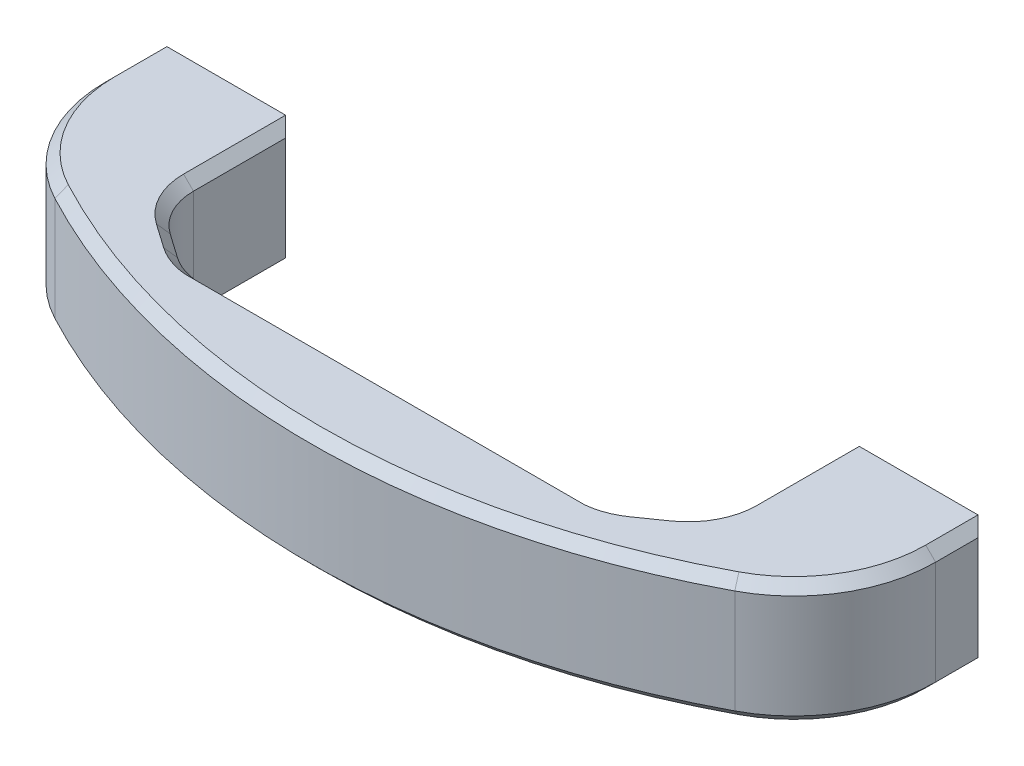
ISO-10303-21;
HEADER;
FILE_DESCRIPTION(('STEP AP214'),'2;1');
FILE_NAME('part.step','',(''),(''),'','','');
FILE_SCHEMA(('AUTOMOTIVE_DESIGN { 1 0 10303 214 1 1 1 1 }'));
ENDSEC;
DATA;
#1=APPLICATION_CONTEXT('core data for automotive mechanical design processes');
#2=APPLICATION_PROTOCOL_DEFINITION('international standard','automotive_design',2000,#1);
#3=PRODUCT_CONTEXT('',#1,'mechanical');
#4=PRODUCT('Part','Part','',(#3));
#5=PRODUCT_RELATED_PRODUCT_CATEGORY('part','',(#4));
#6=PRODUCT_DEFINITION_FORMATION('','',#4);
#7=PRODUCT_DEFINITION_CONTEXT('part definition',#1,'design');
#8=PRODUCT_DEFINITION('design','',#6,#7);
#9=PRODUCT_DEFINITION_SHAPE('','',#8);
#10=(LENGTH_UNIT() NAMED_UNIT(*) SI_UNIT(.MILLI.,.METRE.));
#11=(NAMED_UNIT(*) PLANE_ANGLE_UNIT() SI_UNIT($,.RADIAN.));
#12=(NAMED_UNIT(*) SI_UNIT($,.STERADIAN.) SOLID_ANGLE_UNIT());
#13=UNCERTAINTY_MEASURE_WITH_UNIT(LENGTH_MEASURE(1.E-05),#10,'distance_accuracy_value','');
#14=(GEOMETRIC_REPRESENTATION_CONTEXT(3) GLOBAL_UNCERTAINTY_ASSIGNED_CONTEXT((#13)) GLOBAL_UNIT_ASSIGNED_CONTEXT((#10,
#11,#12)) REPRESENTATION_CONTEXT('',''));
#15=CARTESIAN_POINT('',(0.,0.,0.));
#16=DIRECTION('',(0.,0.,1.));
#17=DIRECTION('',(1.,0.,0.));
#18=AXIS2_PLACEMENT_3D('',#15,#16,#17);
#19=CARTESIAN_POINT('',(135.940063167,-4.048,15.));
#20=DIRECTION('',(0.,0.,-1.));
#21=DIRECTION('',(0.,1.,0.));
#22=AXIS2_PLACEMENT_3D('',#19,#20,#21);
#23=PLANE('',#22);
#24=CARTESIAN_POINT('',(140.001992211,0.,15.));
#25=DIRECTION('',(0.,0.,-1.));
#26=DIRECTION('',(1.,0.,0.));
#27=AXIS2_PLACEMENT_3D('',#24,#25,#26);
#28=CIRCLE('',#27,4.);
#29=CARTESIAN_POINT('',(144.001992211,0.,15.));
#30=VERTEX_POINT('',#29);
#31=EDGE_CURVE('E18',#30,#30,#28,.T.);
#32=ORIENTED_EDGE('',*,*,#31,.T.);
#33=EDGE_LOOP('',(#32));
#34=FACE_BOUND('',#33,.T.);
#35=ADVANCED_FACE('F14',(#34),#23,.T.);
#36=CARTESIAN_POINT('',(14.68886479,-10.5,10.567994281));
#37=DIRECTION('',(0.,1.,0.));
#38=DIRECTION('',(-1.,0.,0.));
#39=AXIS2_PLACEMENT_3D('',#36,#37,#38);
#40=CYLINDRICAL_SURFACE('',#39,28.68886479);
#41=DIRECTION('',(0.,-1.,0.));
#42=VECTOR('',#41,1.);
#43=CARTESIAN_POINT('',(1.26143636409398,0.,35.9206100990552));
#44=LINE('',#43,#42);
#45=CARTESIAN_POINT('',(1.26143634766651,10.5,35.9206100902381));
#46=VERTEX_POINT('',#45);
#47=CARTESIAN_POINT('',(1.26143636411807,-10.5,35.9206100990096));
#48=VERTEX_POINT('',#47);
#49=EDGE_CURVE('E324',#46,#48,#44,.T.);
#50=ORIENTED_EDGE('',*,*,#49,.F.);
#51=CARTESIAN_POINT('',(14.68886479,10.5,10.567994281));
#52=DIRECTION('',(0.,-1.,0.));
#53=DIRECTION('',(1.,0.,0.));
#54=AXIS2_PLACEMENT_3D('',#51,#52,#53);
#55=CIRCLE('',#54,28.68886479);
#56=CARTESIAN_POINT('',(-14.,10.5,10.567994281));
#57=VERTEX_POINT('',#56);
#58=EDGE_CURVE('E390',#57,#46,#55,.F.);
#59=ORIENTED_EDGE('',*,*,#58,.F.);
#60=DIRECTION('',(0.,-1.,0.));
#61=VECTOR('',#60,1.);
#62=CARTESIAN_POINT('',(-14.,0.,10.567994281));
#63=LINE('',#62,#61);
#64=CARTESIAN_POINT('',(-14.,-10.5,10.567994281));
#65=VERTEX_POINT('',#64);
#66=EDGE_CURVE('E386',#57,#65,#63,.T.);
#67=ORIENTED_EDGE('',*,*,#66,.T.);
#68=CARTESIAN_POINT('',(14.68886479,-10.5,10.567994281));
#69=DIRECTION('',(0.,1.,0.));
#70=DIRECTION('',(-1.,0.,0.));
#71=AXIS2_PLACEMENT_3D('',#68,#69,#70);
#72=CIRCLE('',#71,28.68886479);
#73=EDGE_CURVE('E315',#48,#65,#72,.F.);
#74=ORIENTED_EDGE('',*,*,#73,.F.);
#75=EDGE_LOOP('',(#50,#59,#67,#74));
#76=FACE_BOUND('',#75,.T.);
#77=ADVANCED_FACE('F687',(#76),#40,.T.);
#78=CARTESIAN_POINT('',(26.001992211,-10.5,20.631492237));
#79=DIRECTION('',(0.,1.,0.));
#80=DIRECTION('',(-1.,0.,0.));
#81=AXIS2_PLACEMENT_3D('',#78,#79,#80);
#82=CYLINDRICAL_SURFACE('',#81,12.);
#83=CARTESIAN_POINT('',(26.001992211,-10.5,20.631492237));
#84=DIRECTION('',(0.,-1.,0.));
#85=DIRECTION('',(1.,0.,0.));
#86=AXIS2_PLACEMENT_3D('',#83,#84,#85);
#87=CIRCLE('',#86,12.);
#88=CARTESIAN_POINT('',(19.1190749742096,-10.5000000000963,30.461316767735));
#89=VERTEX_POINT('',#88);
#90=CARTESIAN_POINT('',(14.001992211,-10.5,20.6314922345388));
#91=VERTEX_POINT('',#90);
#92=EDGE_CURVE('E307',#89,#91,#87,.T.);
#93=ORIENTED_EDGE('',*,*,#92,.T.);
#94=DIRECTION('',(0.,1.,0.));
#95=VECTOR('',#94,1.);
#96=CARTESIAN_POINT('',(14.001992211,0.,20.631492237));
#97=LINE('',#96,#95);
#98=CARTESIAN_POINT('',(14.001992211,10.5,20.631492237));
#99=VERTEX_POINT('',#98);
#100=EDGE_CURVE('E314',#91,#99,#97,.T.);
#101=ORIENTED_EDGE('',*,*,#100,.T.);
#102=CARTESIAN_POINT('',(26.001992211,10.5,20.631492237));
#103=DIRECTION('',(0.,1.,0.));
#104=DIRECTION('',(-1.,0.,0.));
#105=AXIS2_PLACEMENT_3D('',#102,#103,#104);
#106=CIRCLE('',#105,12.);
#107=CARTESIAN_POINT('',(19.119074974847,10.5000000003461,30.4613167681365));
#108=VERTEX_POINT('',#107);
#109=EDGE_CURVE('E200',#99,#108,#106,.T.);
#110=ORIENTED_EDGE('',*,*,#109,.T.);
#111=DIRECTION('',(0.,-1.,0.));
#112=VECTOR('',#111,1.);
#113=CARTESIAN_POINT('',(19.119074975,0.,30.461316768));
#114=LINE('',#113,#112);
#115=EDGE_CURVE('E379',#108,#89,#114,.T.);
#116=ORIENTED_EDGE('',*,*,#115,.T.);
#117=EDGE_LOOP('',(#93,#101,#110,#116));
#118=FACE_BOUND('',#117,.T.);
#119=ADVANCED_FACE('F807',(#118),#82,.F.);
#120=CARTESIAN_POINT('',(24.0284634,10.5,33.898907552));
#121=DIRECTION('',(-0.573576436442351,0.,0.81915204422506));
#122=DIRECTION('',(-0.81915204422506,0.,-0.573576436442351));
#123=AXIS2_PLACEMENT_3D('',#120,#121,#122);
#124=PLANE('',#123);
#125=DIRECTION('',(0.819152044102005,-3.65264445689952E-10,0.57357643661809));
#126=VECTOR('',#125,1.);
#127=CARTESIAN_POINT('',(19.1190749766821,-10.5000000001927,30.4613167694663));
#128=LINE('',#127,#126);
#129=CARTESIAN_POINT('',(24.0284634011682,-10.5000000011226,33.8989075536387));
#130=VERTEX_POINT('',#129);
#131=EDGE_CURVE('E256',#89,#130,#128,.T.);
#132=ORIENTED_EDGE('',*,*,#131,.F.);
#133=ORIENTED_EDGE('',*,*,#115,.F.);
#134=DIRECTION('',(-0.81915204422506,0.,-0.573576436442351));
#135=VECTOR('',#134,1.);
#136=CARTESIAN_POINT('',(24.0284634,10.5000000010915,33.898907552));
#137=LINE('',#136,#135);
#138=CARTESIAN_POINT('',(24.0284634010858,10.5000000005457,33.8989075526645));
#139=VERTEX_POINT('',#138);
#140=EDGE_CURVE('E196',#108,#139,#137,.F.);
#141=ORIENTED_EDGE('',*,*,#140,.T.);
#142=DIRECTION('',(0.,-1.,0.));
#143=VECTOR('',#142,1.);
#144=CARTESIAN_POINT('',(24.02846340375,0.,33.8989075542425));
#145=LINE('',#144,#143);
#146=EDGE_CURVE('E375',#139,#130,#145,.T.);
#147=ORIENTED_EDGE('',*,*,#146,.T.);
#148=EDGE_LOOP('',(#132,#133,#141,#147));
#149=FACE_BOUND('',#148,.T.);
#150=ADVANCED_FACE('F495',(#149),#124,.F.);
#151=CARTESIAN_POINT('',(30.911380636,-10.5,24.06908302));
#152=DIRECTION('',(0.,1.,0.));
#153=DIRECTION('',(-1.,0.,0.));
#154=AXIS2_PLACEMENT_3D('',#151,#152,#153);
#155=CYLINDRICAL_SURFACE('',#154,12.);
#156=CARTESIAN_POINT('',(30.911380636,-10.5,24.06908302));
#157=DIRECTION('',(0.,-1.,0.));
#158=DIRECTION('',(1.,0.,0.));
#159=AXIS2_PLACEMENT_3D('',#156,#157,#158);
#160=CIRCLE('',#159,12.);
#161=CARTESIAN_POINT('',(29.6074195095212,-10.5,35.9980261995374));
#162=VERTEX_POINT('',#161);
#163=EDGE_CURVE('E258',#162,#130,#160,.T.);
#164=ORIENTED_EDGE('',*,*,#163,.T.);
#165=ORIENTED_EDGE('',*,*,#146,.F.);
#166=CARTESIAN_POINT('',(30.911380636,10.5,24.06908302));
#167=DIRECTION('',(0.,1.,0.));
#168=DIRECTION('',(-1.,0.,0.));
#169=AXIS2_PLACEMENT_3D('',#166,#167,#168);
#170=CIRCLE('',#169,12.);
#171=CARTESIAN_POINT('',(29.6074195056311,10.5000000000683,35.9980261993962));
#172=VERTEX_POINT('',#171);
#173=EDGE_CURVE('E290',#139,#172,#170,.T.);
#174=ORIENTED_EDGE('',*,*,#173,.T.);
#175=DIRECTION('',(0.,-1.,0.));
#176=VECTOR('',#175,1.);
#177=CARTESIAN_POINT('',(29.607419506,0.,35.998026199));
#178=LINE('',#177,#176);
#179=EDGE_CURVE('E372',#172,#162,#178,.T.);
#180=ORIENTED_EDGE('',*,*,#179,.T.);
#181=EDGE_LOOP('',(#164,#165,#174,#180));
#182=FACE_BOUND('',#181,.T.);
#183=ADVANCED_FACE('F491',(#182),#155,.F.);
#184=CARTESIAN_POINT('',(29.824746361,10.5,36.009869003));
#185=DIRECTION('',(-0.0544123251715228,0.,0.99851855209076));
#186=DIRECTION('',(-0.99851855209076,0.,-0.0544123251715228));
#187=AXIS2_PLACEMENT_3D('',#184,#185,#186);
#188=PLANE('',#187);
#189=DIRECTION('',(0.,-1.,0.));
#190=VECTOR('',#189,1.);
#191=CARTESIAN_POINT('',(29.824746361,0.,36.009869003));
#192=LINE('',#191,#190);
#193=CARTESIAN_POINT('',(29.8247463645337,10.4999999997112,36.0098690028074));
#194=VERTEX_POINT('',#193);
#195=CARTESIAN_POINT('',(29.824746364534,-10.4999999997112,36.0098690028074));
#196=VERTEX_POINT('',#195);
#197=EDGE_CURVE('E367',#194,#196,#192,.T.);
#198=ORIENTED_EDGE('',*,*,#197,.T.);
#199=DIRECTION('',(0.998518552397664,4.07689638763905E-09,0.0544123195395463));
#200=VECTOR('',#199,1.);
#201=CARTESIAN_POINT('',(29.6074195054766,-10.5000000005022,35.9980261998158));
#202=LINE('',#201,#200);
#203=EDGE_CURVE('E249',#162,#196,#202,.T.);
#204=ORIENTED_EDGE('',*,*,#203,.F.);
#205=ORIENTED_EDGE('',*,*,#179,.F.);
#206=DIRECTION('',(-0.998518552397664,4.0768963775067E-09,-0.0544123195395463));
#207=VECTOR('',#206,1.);
#208=CARTESIAN_POINT('',(29.824746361,10.4999999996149,36.0098690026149));
#209=LINE('',#208,#207);
#210=EDGE_CURVE('E287',#194,#172,#209,.T.);
#211=ORIENTED_EDGE('',*,*,#210,.F.);
#212=EDGE_LOOP('',(#198,#204,#205,#211));
#213=FACE_BOUND('',#212,.T.);
#214=ADVANCED_FACE('F553',(#213),#188,.F.);
#215=CARTESIAN_POINT('',(110.179238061,10.5,36.009869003));
#216=DIRECTION('',(0.,0.,1.));
#217=DIRECTION('',(-1.,0.,0.));
#218=AXIS2_PLACEMENT_3D('',#215,#216,#217);
#219=PLANE('',#218);
#220=ORIENTED_EDGE('',*,*,#197,.F.);
#221=DIRECTION('',(1.,0.,0.));
#222=VECTOR('',#221,1.);
#223=CARTESIAN_POINT('',(70.001992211,10.5,36.009869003));
#224=LINE('',#223,#222);
#225=CARTESIAN_POINT('',(110.179238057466,10.4999999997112,36.0098690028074));
#226=VERTEX_POINT('',#225);
#227=EDGE_CURVE('E283',#194,#226,#224,.T.);
#228=ORIENTED_EDGE('',*,*,#227,.T.);
#229=DIRECTION('',(0.,-1.,0.));
#230=VECTOR('',#229,1.);
#231=CARTESIAN_POINT('',(110.179238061,0.,36.009869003));
#232=LINE('',#231,#230);
#233=CARTESIAN_POINT('',(110.179238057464,-10.4999999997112,36.0098690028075));
#234=VERTEX_POINT('',#233);
#235=EDGE_CURVE('E364',#226,#234,#232,.T.);
#236=ORIENTED_EDGE('',*,*,#235,.T.);
#237=DIRECTION('',(1.,0.,0.));
#238=VECTOR('',#237,1.);
#239=CARTESIAN_POINT('',(70.001992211,-10.5,36.009869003));
#240=LINE('',#239,#238);
#241=EDGE_CURVE('E368',#196,#234,#240,.T.);
#242=ORIENTED_EDGE('',*,*,#241,.F.);
#243=EDGE_LOOP('',(#220,#228,#236,#242));
#244=FACE_BOUND('',#243,.T.);
#245=ADVANCED_FACE('F556',(#244),#219,.F.);
#246=CARTESIAN_POINT('',(110.396564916,10.5,35.998026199));
#247=DIRECTION('',(0.0544123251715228,0.,0.99851855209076));
#248=DIRECTION('',(-0.99851855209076,0.,0.0544123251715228));
#249=AXIS2_PLACEMENT_3D('',#246,#247,#248);
#250=PLANE('',#249);
#251=DIRECTION('',(0.,-1.,0.));
#252=VECTOR('',#251,1.);
#253=CARTESIAN_POINT('',(110.396564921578,0.,35.9980261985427));
#254=LINE('',#253,#252);
#255=CARTESIAN_POINT('',(110.396564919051,10.5000000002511,35.9980261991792));
#256=VERTEX_POINT('',#255);
#257=CARTESIAN_POINT('',(110.396564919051,-10.5000000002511,35.9980261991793));
#258=VERTEX_POINT('',#257);
#259=EDGE_CURVE('E359',#256,#258,#254,.T.);
#260=ORIENTED_EDGE('',*,*,#259,.T.);
#261=DIRECTION('',(0.998518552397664,-4.07689638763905E-09,-0.0544123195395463));
#262=VECTOR('',#261,1.);
#263=CARTESIAN_POINT('',(110.179238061,-10.4999999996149,36.0098690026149));
#264=LINE('',#263,#262);
#265=EDGE_CURVE('E245',#234,#258,#264,.T.);
#266=ORIENTED_EDGE('',*,*,#265,.F.);
#267=ORIENTED_EDGE('',*,*,#235,.F.);
#268=DIRECTION('',(-0.998518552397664,-4.0768963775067E-09,0.0544123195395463));
#269=VECTOR('',#268,1.);
#270=CARTESIAN_POINT('',(110.396564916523,10.5000000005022,35.9980261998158));
#271=LINE('',#270,#269);
#272=EDGE_CURVE('E279',#256,#226,#271,.T.);
#273=ORIENTED_EDGE('',*,*,#272,.F.);
#274=EDGE_LOOP('',(#260,#266,#267,#273));
#275=FACE_BOUND('',#274,.T.);
#276=ADVANCED_FACE('F758',(#275),#250,.F.);
#277=CARTESIAN_POINT('',(109.092603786,-10.5,24.06908302));
#278=DIRECTION('',(0.,1.,0.));
#279=DIRECTION('',(-1.,0.,0.));
#280=AXIS2_PLACEMENT_3D('',#277,#278,#279);
#281=CYLINDRICAL_SURFACE('',#280,12.);
#282=CARTESIAN_POINT('',(109.092603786,-10.5,24.06908302));
#283=DIRECTION('',(0.,-1.,0.));
#284=DIRECTION('',(1.,0.,0.));
#285=AXIS2_PLACEMENT_3D('',#282,#283,#284);
#286=CIRCLE('',#285,12.);
#287=CARTESIAN_POINT('',(115.975521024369,-10.5000000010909,33.8989075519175));
#288=VERTEX_POINT('',#287);
#289=EDGE_CURVE('E247',#288,#258,#286,.T.);
#290=ORIENTED_EDGE('',*,*,#289,.T.);
#291=ORIENTED_EDGE('',*,*,#259,.F.);
#292=CARTESIAN_POINT('',(109.092603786,10.5,24.06908302));
#293=DIRECTION('',(0.,1.,0.));
#294=DIRECTION('',(-1.,0.,0.));
#295=AXIS2_PLACEMENT_3D('',#292,#293,#294);
#296=CIRCLE('',#295,12.);
#297=CARTESIAN_POINT('',(115.975521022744,10.5000000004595,33.8989075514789));
#298=VERTEX_POINT('',#297);
#299=EDGE_CURVE('E278',#256,#298,#296,.T.);
#300=ORIENTED_EDGE('',*,*,#299,.T.);
#301=DIRECTION('',(0.,-1.,0.));
#302=VECTOR('',#301,1.);
#303=CARTESIAN_POINT('',(115.975521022,0.,33.898907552));
#304=LINE('',#303,#302);
#305=EDGE_CURVE('E356',#298,#288,#304,.T.);
#306=ORIENTED_EDGE('',*,*,#305,.T.);
#307=EDGE_LOOP('',(#290,#291,#300,#306));
#308=FACE_BOUND('',#307,.T.);
#309=ADVANCED_FACE('F765',(#308),#281,.F.);
#310=CARTESIAN_POINT('',(120.884909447,10.5,30.461316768));
#311=DIRECTION('',(0.573576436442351,0.,0.81915204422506));
#312=DIRECTION('',(-0.81915204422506,0.,0.573576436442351));
#313=AXIS2_PLACEMENT_3D('',#310,#311,#312);
#314=PLANE('',#313);
#315=DIRECTION('',(0.819152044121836,3.99839625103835E-10,-0.573576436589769));
#316=VECTOR('',#315,1.);
#317=CARTESIAN_POINT('',(115.975521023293,-10.5000000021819,33.8989075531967));
#318=LINE('',#317,#316);
#319=CARTESIAN_POINT('',(120.884909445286,-10.4999999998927,30.4613167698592));
#320=VERTEX_POINT('',#319);
#321=EDGE_CURVE('E238',#288,#320,#318,.T.);
#322=ORIENTED_EDGE('',*,*,#321,.F.);
#323=ORIENTED_EDGE('',*,*,#305,.F.);
#324=DIRECTION('',(-0.81915204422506,0.,0.573576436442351));
#325=VECTOR('',#324,1.);
#326=CARTESIAN_POINT('',(120.884909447,10.5000000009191,30.461316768));
#327=LINE('',#326,#325);
#328=CARTESIAN_POINT('',(120.884909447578,10.5000000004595,30.4613167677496));
#329=VERTEX_POINT('',#328);
#330=EDGE_CURVE('E271',#298,#329,#327,.F.);
#331=ORIENTED_EDGE('',*,*,#330,.T.);
#332=DIRECTION('',(0.,-1.,0.));
#333=VECTOR('',#332,1.);
#334=CARTESIAN_POINT('',(120.884909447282,0.,30.4613167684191));
#335=LINE('',#334,#333);
#336=EDGE_CURVE('E348',#329,#320,#335,.T.);
#337=ORIENTED_EDGE('',*,*,#336,.T.);
#338=EDGE_LOOP('',(#322,#323,#331,#337));
#339=FACE_BOUND('',#338,.T.);
#340=ADVANCED_FACE('F767',(#339),#314,.F.);
#341=CARTESIAN_POINT('',(114.001992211,-10.5,20.631492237));
#342=DIRECTION('',(0.,1.,0.));
#343=DIRECTION('',(-1.,0.,0.));
#344=AXIS2_PLACEMENT_3D('',#341,#342,#343);
#345=CYLINDRICAL_SURFACE('',#344,12.);
#346=CARTESIAN_POINT('',(114.001992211,-10.5,20.631492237));
#347=DIRECTION('',(0.,-1.,0.));
#348=DIRECTION('',(1.,0.,0.));
#349=AXIS2_PLACEMENT_3D('',#346,#347,#348);
#350=CIRCLE('',#349,12.);
#351=CARTESIAN_POINT('',(126.001992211,-10.5,20.631492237));
#352=VERTEX_POINT('',#351);
#353=EDGE_CURVE('E240',#352,#320,#350,.T.);
#354=ORIENTED_EDGE('',*,*,#353,.T.);
#355=ORIENTED_EDGE('',*,*,#336,.F.);
#356=CARTESIAN_POINT('',(114.001992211,10.5,20.631492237));
#357=DIRECTION('',(0.,1.,0.));
#358=DIRECTION('',(-1.,0.,0.));
#359=AXIS2_PLACEMENT_3D('',#356,#357,#358);
#360=CIRCLE('',#359,12.);
#361=CARTESIAN_POINT('',(126.001992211,10.5,20.6314922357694));
#362=VERTEX_POINT('',#361);
#363=EDGE_CURVE('E407',#329,#362,#360,.T.);
#364=ORIENTED_EDGE('',*,*,#363,.T.);
#365=DIRECTION('',(0.,-1.,0.));
#366=VECTOR('',#365,1.);
#367=CARTESIAN_POINT('',(126.001992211,0.,20.631492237));
#368=LINE('',#367,#366);
#369=EDGE_CURVE('E344',#362,#352,#368,.T.);
#370=ORIENTED_EDGE('',*,*,#369,.T.);
#371=EDGE_LOOP('',(#354,#355,#364,#370));
#372=FACE_BOUND('',#371,.T.);
#373=ADVANCED_FACE('F769',(#372),#345,.F.);
#374=CARTESIAN_POINT('',(126.001992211,-10.5,2.));
#375=DIRECTION('',(1.,0.,0.));
#376=DIRECTION('',(0.,1.,0.));
#377=AXIS2_PLACEMENT_3D('',#374,#375,#376);
#378=PLANE('',#377);
#379=DIRECTION('',(0.,0.,-1.));
#380=VECTOR('',#379,1.);
#381=CARTESIAN_POINT('',(126.001992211,-10.5,10.253851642));
#382=LINE('',#381,#380);
#383=CARTESIAN_POINT('',(126.001992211,-10.5,2.000000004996));
#384=VERTEX_POINT('',#383);
#385=EDGE_CURVE('E349',#352,#384,#382,.T.);
#386=ORIENTED_EDGE('',*,*,#385,.F.);
#387=ORIENTED_EDGE('',*,*,#369,.F.);
#388=DIRECTION('',(0.,0.,-1.));
#389=VECTOR('',#388,1.);
#390=CARTESIAN_POINT('',(126.001992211,10.5,10.253851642));
#391=LINE('',#390,#389);
#392=CARTESIAN_POINT('',(126.001992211,10.500000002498,2.));
#393=VERTEX_POINT('',#392);
#394=EDGE_CURVE('E270',#362,#393,#391,.T.);
#395=ORIENTED_EDGE('',*,*,#394,.T.);
#396=DIRECTION('',(0.,-1.,0.));
#397=VECTOR('',#396,1.);
#398=CARTESIAN_POINT('',(126.001992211,0.,2.));
#399=LINE('',#398,#397);
#400=EDGE_CURVE('E347',#393,#384,#399,.T.);
#401=ORIENTED_EDGE('',*,*,#400,.T.);
#402=EDGE_LOOP('',(#386,#387,#395,#401));
#403=FACE_BOUND('',#402,.T.);
#404=ADVANCED_FACE('F777',(#403),#378,.F.);
#405=CARTESIAN_POINT('',(128.001992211,12.65,0.));
#406=DIRECTION('',(0.707106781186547,0.,0.707106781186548));
#407=DIRECTION('',(-0.707106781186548,0.,0.707106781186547));
#408=AXIS2_PLACEMENT_3D('',#405,#406,#407);
#409=PLANE('',#408);
#410=DIRECTION('',(0.,-1.,0.));
#411=VECTOR('',#410,1.);
#412=CARTESIAN_POINT('',(128.001992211,0.,0.));
#413=LINE('',#412,#411);
#414=CARTESIAN_POINT('',(128.001992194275,12.4999999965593,1.16833683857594E-08));
#415=VERTEX_POINT('',#414);
#416=CARTESIAN_POINT('',(128.001992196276,-12.4999999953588,1.48846783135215E-08));
#417=VERTEX_POINT('',#416);
#418=EDGE_CURVE('E352',#415,#417,#413,.T.);
#419=ORIENTED_EDGE('',*,*,#418,.T.);
#420=DIRECTION('',(0.577350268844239,-0.577350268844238,-0.5773502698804));
#421=VECTOR('',#420,1.);
#422=CARTESIAN_POINT('',(126.001992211,-10.5,2.00000000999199));
#423=LINE('',#422,#421);
#424=EDGE_CURVE('E234',#384,#417,#423,.T.);
#425=ORIENTED_EDGE('',*,*,#424,.F.);
#426=ORIENTED_EDGE('',*,*,#400,.F.);
#427=DIRECTION('',(0.57735026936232,0.577350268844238,-0.577350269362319));
#428=VECTOR('',#427,1.);
#429=CARTESIAN_POINT('',(126.001992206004,10.5,2.000000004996));
#430=LINE('',#429,#428);
#431=EDGE_CURVE('E267',#393,#415,#430,.T.);
#432=ORIENTED_EDGE('',*,*,#431,.T.);
#433=EDGE_LOOP('',(#419,#425,#426,#432));
#434=FACE_BOUND('',#433,.T.);
#435=ADVANCED_FACE('F775',(#434),#409,.F.);
#436=CARTESIAN_POINT('',(140.001992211,0.,15.));
#437=DIRECTION('',(0.,0.,-1.));
#438=DIRECTION('',(1.,0.,0.));
#439=AXIS2_PLACEMENT_3D('',#436,#437,#438);
#440=CYLINDRICAL_SURFACE('',#439,4.);
#441=ORIENTED_EDGE('',*,*,#31,.F.);
#442=EDGE_LOOP('',(#441));
#443=FACE_BOUND('',#442,.T.);
#444=CARTESIAN_POINT('',(140.001992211,0.,0.));
#445=DIRECTION('',(0.,0.,-1.));
#446=DIRECTION('',(1.,0.,0.));
#447=AXIS2_PLACEMENT_3D('',#444,#445,#446);
#448=CIRCLE('',#447,4.);
#449=CARTESIAN_POINT('',(144.001992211,0.,0.));
#450=VERTEX_POINT('',#449);
#451=EDGE_CURVE('E230',#450,#450,#448,.T.);
#452=ORIENTED_EDGE('',*,*,#451,.T.);
#453=EDGE_LOOP('',(#452));
#454=FACE_BOUND('',#453,.T.);
#455=ADVANCED_FACE('F785',(#443,#454),#440,.F.);
#456=CARTESIAN_POINT('',(154.001992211,12.65,2.));
#457=DIRECTION('',(-0.707106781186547,0.,0.707106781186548));
#458=DIRECTION('',(-0.707106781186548,0.,-0.707106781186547));
#459=AXIS2_PLACEMENT_3D('',#456,#457,#458);
#460=PLANE('',#459);
#461=DIRECTION('',(0.,-1.,0.));
#462=VECTOR('',#461,1.);
#463=CARTESIAN_POINT('',(154.001992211,0.,2.));
#464=LINE('',#463,#462);
#465=CARTESIAN_POINT('',(154.001992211,10.4999999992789,2.));
#466=VERTEX_POINT('',#465);
#467=CARTESIAN_POINT('',(154.001992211,-10.5,1.99999999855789));
#468=VERTEX_POINT('',#467);
#469=EDGE_CURVE('E337',#466,#468,#464,.T.);
#470=ORIENTED_EDGE('',*,*,#469,.T.);
#471=DIRECTION('',(0.577350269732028,0.577350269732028,0.577350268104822));
#472=VECTOR('',#471,1.);
#473=CARTESIAN_POINT('',(152.001992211,-12.5,2.75259228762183E-09));
#474=LINE('',#473,#472);
#475=CARTESIAN_POINT('',(152.001992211,-12.5,1.37629640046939E-09));
#476=VERTEX_POINT('',#475);
#477=EDGE_CURVE('E227',#476,#468,#474,.T.);
#478=ORIENTED_EDGE('',*,*,#477,.F.);
#479=DIRECTION('',(0.,1.,0.));
#480=VECTOR('',#479,1.);
#481=CARTESIAN_POINT('',(152.001992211,0.,0.));
#482=LINE('',#481,#480);
#483=CARTESIAN_POINT('',(152.001992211,12.5000000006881,0.));
#484=VERTEX_POINT('',#483);
#485=EDGE_CURVE('E233',#476,#484,#482,.T.);
#486=ORIENTED_EDGE('',*,*,#485,.T.);
#487=DIRECTION('',(0.577350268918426,-0.577350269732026,0.577350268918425));
#488=VECTOR('',#487,1.);
#489=CARTESIAN_POINT('',(152.001992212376,12.5,1.37629808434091E-09));
#490=LINE('',#489,#488);
#491=EDGE_CURVE('E263',#484,#466,#490,.T.);
#492=ORIENTED_EDGE('',*,*,#491,.T.);
#493=EDGE_LOOP('',(#470,#478,#486,#492));
#494=FACE_BOUND('',#493,.T.);
#495=ADVANCED_FACE('F735',(#494),#460,.F.);
#496=CARTESIAN_POINT('',(154.001992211,10.5,10.567994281));
#497=DIRECTION('',(-1.,0.,0.));
#498=DIRECTION('',(0.,0.,-1.));
#499=AXIS2_PLACEMENT_3D('',#496,#497,#498);
#500=PLANE('',#499);
#501=DIRECTION('',(0.,0.,1.));
#502=VECTOR('',#501,1.);
#503=CARTESIAN_POINT('',(154.001992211,-10.5,5.2522931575));
#504=LINE('',#503,#502);
#505=CARTESIAN_POINT('',(154.001992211,-10.5,10.5679942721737));
#506=VERTEX_POINT('',#505);
#507=EDGE_CURVE('E229',#468,#506,#504,.T.);
#508=ORIENTED_EDGE('',*,*,#507,.F.);
#509=ORIENTED_EDGE('',*,*,#469,.F.);
#510=DIRECTION('',(0.,0.,1.));
#511=VECTOR('',#510,1.);
#512=CARTESIAN_POINT('',(154.001992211,10.5,5.2522931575));
#513=LINE('',#512,#511);
#514=CARTESIAN_POINT('',(154.001992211,10.5,10.5679942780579));
#515=VERTEX_POINT('',#514);
#516=EDGE_CURVE('E266',#466,#515,#513,.T.);
#517=ORIENTED_EDGE('',*,*,#516,.T.);
#518=DIRECTION('',(0.,1.,0.));
#519=VECTOR('',#518,1.);
#520=CARTESIAN_POINT('',(154.001992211,0.,10.5679942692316));
#521=LINE('',#520,#519);
#522=EDGE_CURVE('E328',#506,#515,#521,.T.);
#523=ORIENTED_EDGE('',*,*,#522,.F.);
#524=EDGE_LOOP('',(#508,#509,#517,#523));
#525=FACE_BOUND('',#524,.T.);
#526=ADVANCED_FACE('F733',(#525),#500,.F.);
#527=CARTESIAN_POINT('',(125.313127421,-10.5,10.567994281));
#528=DIRECTION('',(0.,1.,0.));
#529=DIRECTION('',(-1.,0.,0.));
#530=AXIS2_PLACEMENT_3D('',#527,#528,#529);
#531=CYLINDRICAL_SURFACE('',#530,28.68886479);
#532=ORIENTED_EDGE('',*,*,#522,.T.);
#533=CARTESIAN_POINT('',(125.313127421,10.5,10.567994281));
#534=DIRECTION('',(0.,-1.,0.));
#535=DIRECTION('',(1.,0.,0.));
#536=AXIS2_PLACEMENT_3D('',#533,#534,#535);
#537=CIRCLE('',#536,28.68886479);
#538=CARTESIAN_POINT('',(138.740555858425,10.5,35.920610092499));
#539=VERTEX_POINT('',#538);
#540=EDGE_CURVE('E398',#539,#515,#537,.F.);
#541=ORIENTED_EDGE('',*,*,#540,.F.);
#542=DIRECTION('',(0.,1.,0.));
#543=VECTOR('',#542,1.);
#544=CARTESIAN_POINT('',(138.740555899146,0.,35.9206100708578));
#545=LINE('',#544,#543);
#546=CARTESIAN_POINT('',(138.740555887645,-10.5,35.9206100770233));
#547=VERTEX_POINT('',#546);
#548=EDGE_CURVE('E327',#547,#539,#545,.T.);
#549=ORIENTED_EDGE('',*,*,#548,.F.);
#550=CARTESIAN_POINT('',(125.313127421,-10.5,10.567994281));
#551=DIRECTION('',(0.,1.,0.));
#552=DIRECTION('',(-1.,0.,0.));
#553=AXIS2_PLACEMENT_3D('',#550,#551,#552);
#554=CIRCLE('',#553,28.68886479);
#555=EDGE_CURVE('E331',#506,#547,#554,.F.);
#556=ORIENTED_EDGE('',*,*,#555,.F.);
#557=EDGE_LOOP('',(#532,#541,#549,#556));
#558=FACE_BOUND('',#557,.T.);
#559=ADVANCED_FACE('F731',(#558),#531,.T.);
#560=CARTESIAN_POINT('',(70.000996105,-10.5,-93.868028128));
#561=DIRECTION('',(0.,1.,0.));
#562=DIRECTION('',(-1.,0.,0.));
#563=AXIS2_PLACEMENT_3D('',#560,#561,#562);
#564=CYLINDRICAL_SURFACE('',#563,146.868028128);
#565=ORIENTED_EDGE('',*,*,#548,.T.);
#566=CARTESIAN_POINT('',(70.000996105,10.5,-93.868028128));
#567=DIRECTION('',(0.,-1.,0.));
#568=DIRECTION('',(1.,0.,0.));
#569=AXIS2_PLACEMENT_3D('',#566,#567,#568);
#570=CIRCLE('',#569,146.868028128);
#571=EDGE_CURVE('E394',#46,#539,#570,.F.);
#572=ORIENTED_EDGE('',*,*,#571,.F.);
#573=ORIENTED_EDGE('',*,*,#49,.T.);
#574=CARTESIAN_POINT('',(70.000996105,-10.5,-93.868028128));
#575=DIRECTION('',(0.,1.,0.));
#576=DIRECTION('',(-1.,0.,0.));
#577=AXIS2_PLACEMENT_3D('',#574,#575,#576);
#578=CIRCLE('',#577,146.868028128);
#579=EDGE_CURVE('E320',#547,#48,#578,.F.);
#580=ORIENTED_EDGE('',*,*,#579,.F.);
#581=EDGE_LOOP('',(#565,#572,#573,#580));
#582=FACE_BOUND('',#581,.T.);
#583=ADVANCED_FACE('F729',(#582),#564,.T.);
#584=CARTESIAN_POINT('',(14.001992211,10.5,2.));
#585=DIRECTION('',(-1.,0.,0.));
#586=DIRECTION('',(0.,-1.,0.));
#587=AXIS2_PLACEMENT_3D('',#584,#585,#586);
#588=PLANE('',#587);
#589=DIRECTION('',(0.,0.,1.));
#590=VECTOR('',#589,1.);
#591=CARTESIAN_POINT('',(14.001992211,-10.5,10.253851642));
#592=LINE('',#591,#590);
#593=CARTESIAN_POINT('',(14.001992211,-10.5,2.000000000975));
#594=VERTEX_POINT('',#593);
#595=EDGE_CURVE('E304',#594,#91,#592,.T.);
#596=ORIENTED_EDGE('',*,*,#595,.F.);
#597=DIRECTION('',(0.,1.,0.));
#598=VECTOR('',#597,1.);
#599=CARTESIAN_POINT('',(14.001992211,0.,2.));
#600=LINE('',#599,#598);
#601=CARTESIAN_POINT('',(14.001992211,10.5,2.00000000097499));
#602=VERTEX_POINT('',#601);
#603=EDGE_CURVE('E226',#594,#602,#600,.T.);
#604=ORIENTED_EDGE('',*,*,#603,.T.);
#605=DIRECTION('',(0.,0.,1.));
#606=VECTOR('',#605,1.);
#607=CARTESIAN_POINT('',(14.001992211,10.5,10.253851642));
#608=LINE('',#607,#606);
#609=EDGE_CURVE('E303',#602,#99,#608,.T.);
#610=ORIENTED_EDGE('',*,*,#609,.T.);
#611=ORIENTED_EDGE('',*,*,#100,.F.);
#612=EDGE_LOOP('',(#596,#604,#610,#611));
#613=FACE_BOUND('',#612,.T.);
#614=ADVANCED_FACE('F620',(#613),#588,.F.);
#615=CARTESIAN_POINT('',(12.001992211,12.5,-0.123788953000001));
#616=DIRECTION('',(-0.707106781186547,-0.707106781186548,0.));
#617=DIRECTION('',(0.707106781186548,-0.707106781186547,0.));
#618=AXIS2_PLACEMENT_3D('',#615,#616,#617);
#619=PLANE('',#618);
#620=ORIENTED_EDGE('',*,*,#609,.F.);
#621=DIRECTION('',(-0.57735026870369,0.577350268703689,-0.577350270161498));
#622=VECTOR('',#621,1.);
#623=CARTESIAN_POINT('',(14.00199220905,10.50000000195,2.));
#624=LINE('',#623,#622);
#625=CARTESIAN_POINT('',(12.0019921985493,12.5000000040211,-1.07546110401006E-08));
#626=VERTEX_POINT('',#625);
#627=EDGE_CURVE('E223',#602,#626,#624,.T.);
#628=ORIENTED_EDGE('',*,*,#627,.T.);
#629=DIRECTION('',(0.,0.,1.));
#630=VECTOR('',#629,1.);
#631=CARTESIAN_POINT('',(12.0019921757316,12.5,26.2162165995));
#632=LINE('',#631,#630);
#633=CARTESIAN_POINT('',(12.0019921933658,12.5,20.631492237));
#634=VERTEX_POINT('',#633);
#635=EDGE_CURVE('E215',#626,#634,#632,.T.);
#636=ORIENTED_EDGE('',*,*,#635,.T.);
#637=DIRECTION('',(0.707106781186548,-0.707106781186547,0.));
#638=VECTOR('',#637,1.);
#639=CARTESIAN_POINT('',(13.001992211,11.5,20.631492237));
#640=LINE('',#639,#638);
#641=EDGE_CURVE('E214',#634,#99,#640,.T.);
#642=ORIENTED_EDGE('',*,*,#641,.T.);
#643=EDGE_LOOP('',(#620,#628,#636,#642));
#644=FACE_BOUND('',#643,.T.);
#645=ADVANCED_FACE('F615',(#644),#619,.F.);
#646=CARTESIAN_POINT('',(26.001992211,10.5,20.631492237));
#647=DIRECTION('',(0.,1.,0.));
#648=DIRECTION('',(-1.,0.,0.));
#649=AXIS2_PLACEMENT_3D('',#646,#647,#648);
#650=CONICAL_SURFACE('',#649,12.,0.785398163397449);
#651=ORIENTED_EDGE('',*,*,#109,.F.);
#652=ORIENTED_EDGE('',*,*,#641,.F.);
#653=CARTESIAN_POINT('',(26.001992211,12.5,20.631492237));
#654=DIRECTION('',(0.,1.,0.));
#655=DIRECTION('',(-1.,0.,0.));
#656=AXIS2_PLACEMENT_3D('',#653,#654,#655);
#657=CIRCLE('',#656,14.);
#658=CARTESIAN_POINT('',(17.9719221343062,12.4999999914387,32.0996208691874));
#659=VERTEX_POINT('',#658);
#660=EDGE_CURVE('E206',#634,#659,#657,.T.);
#661=ORIENTED_EDGE('',*,*,#660,.T.);
#662=DIRECTION('',(-0.405579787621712,0.707106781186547,0.579227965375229));
#663=VECTOR('',#662,1.);
#664=CARTESIAN_POINT('',(19.1190749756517,10.5,30.4613167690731));
#665=LINE('',#664,#663);
#666=EDGE_CURVE('E190',#659,#108,#665,.F.);
#667=ORIENTED_EDGE('',*,*,#666,.T.);
#668=EDGE_LOOP('',(#651,#652,#661,#667));
#669=FACE_BOUND('',#668,.T.);
#670=ADVANCED_FACE('F212',(#669),#650,.F.);
#671=CARTESIAN_POINT('',(17.935582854,14.217375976,34.170704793));
#672=DIRECTION('',(-0.405579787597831,-0.707106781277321,0.579227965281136));
#673=DIRECTION('',(0.,-0.633687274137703,-0.773589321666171));
#674=AXIS2_PLACEMENT_3D('',#671,#672,#673);
#675=PLANE('',#674);
#676=ORIENTED_EDGE('',*,*,#140,.F.);
#677=ORIENTED_EDGE('',*,*,#666,.F.);
#678=DIRECTION('',(0.819152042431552,3.27761180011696E-09,0.573576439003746));
#679=VECTOR('',#678,1.);
#680=CARTESIAN_POINT('',(17.9719221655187,12.4999999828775,32.099620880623));
#681=LINE('',#680,#679);
#682=CARTESIAN_POINT('',(22.8813105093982,12.5000000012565,35.5372116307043));
#683=VERTEX_POINT('',#682);
#684=EDGE_CURVE('E194',#659,#683,#681,.T.);
#685=ORIENTED_EDGE('',*,*,#684,.T.);
#686=DIRECTION('',(0.405579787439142,-0.70710678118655,-0.579227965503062));
#687=VECTOR('',#686,1.);
#688=CARTESIAN_POINT('',(23.4548869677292,11.5,34.7180595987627));
#689=LINE('',#688,#687);
#690=EDGE_CURVE('E291',#683,#139,#689,.T.);
#691=ORIENTED_EDGE('',*,*,#690,.T.);
#692=EDGE_LOOP('',(#676,#677,#685,#691));
#693=FACE_BOUND('',#692,.T.);
#694=ADVANCED_FACE('F192',(#693),#675,.F.);
#695=CARTESIAN_POINT('',(30.911380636,10.5,24.06908302));
#696=DIRECTION('',(0.,1.,0.));
#697=DIRECTION('',(-1.,0.,0.));
#698=AXIS2_PLACEMENT_3D('',#695,#696,#697);
#699=CONICAL_SURFACE('',#698,12.,0.785398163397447);
#700=ORIENTED_EDGE('',*,*,#173,.F.);
#701=ORIENTED_EDGE('',*,*,#690,.F.);
#702=CARTESIAN_POINT('',(30.911380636,12.5,24.06908302));
#703=DIRECTION('',(0.,1.,0.));
#704=DIRECTION('',(-1.,0.,0.));
#705=AXIS2_PLACEMENT_3D('',#702,#703,#704);
#706=CIRCLE('',#705,14.);
#707=CARTESIAN_POINT('',(29.3900926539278,12.5000000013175,37.9861833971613));
#708=VERTEX_POINT('',#707);
#709=EDGE_CURVE('E210',#683,#708,#706,.T.);
#710=ORIENTED_EDGE('',*,*,#709,.T.);
#711=DIRECTION('',(-0.0768366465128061,0.707106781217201,0.702919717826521));
#712=VECTOR('',#711,1.);
#713=CARTESIAN_POINT('',(29.6074195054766,10.5000000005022,35.9980261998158));
#714=LINE('',#713,#712);
#715=EDGE_CURVE('E284',#172,#708,#714,.T.);
#716=ORIENTED_EDGE('',*,*,#715,.F.);
#717=EDGE_LOOP('',(#700,#701,#710,#716));
#718=FACE_BOUND('',#717,.T.);
#719=ADVANCED_FACE('F489',(#718),#699,.F.);
#720=CARTESIAN_POINT('',(29.387484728,10.49395693,35.979998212));
#721=DIRECTION('',(0.0385038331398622,0.706582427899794,-0.706582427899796));
#722=DIRECTION('',(0.,0.707106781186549,0.707106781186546));
#723=AXIS2_PLACEMENT_3D('',#720,#721,#722);
#724=PLANE('',#723);
#725=ORIENTED_EDGE('',*,*,#715,.T.);
#726=DIRECTION('',(0.998518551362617,1.49736351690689E-08,0.0544123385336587));
#727=VECTOR('',#726,1.);
#728=CARTESIAN_POINT('',(29.3900926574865,12.5000000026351,37.9861833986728));
#729=LINE('',#728,#727);
#730=CARTESIAN_POINT('',(29.8247464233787,12.5000000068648,38.0098690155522));
#731=VERTEX_POINT('',#730);
#732=EDGE_CURVE('E485',#708,#731,#729,.T.);
#733=ORIENTED_EDGE('',*,*,#732,.T.);
#734=DIRECTION('',(0.,-0.707106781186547,-0.707106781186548));
#735=VECTOR('',#734,1.);
#736=CARTESIAN_POINT('',(29.824746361,11.5,37.009869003));
#737=LINE('',#736,#735);
#738=EDGE_CURVE('E286',#731,#194,#737,.T.);
#739=ORIENTED_EDGE('',*,*,#738,.T.);
#740=ORIENTED_EDGE('',*,*,#210,.T.);
#741=EDGE_LOOP('',(#725,#733,#739,#740));
#742=FACE_BOUND('',#741,.T.);
#743=ADVANCED_FACE('F550',(#742),#724,.T.);
#744=CARTESIAN_POINT('',(29.824746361,12.5,38.009869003));
#745=DIRECTION('',(0.,-0.707106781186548,0.707106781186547));
#746=DIRECTION('',(0.,-0.707106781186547,-0.707106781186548));
#747=AXIS2_PLACEMENT_3D('',#744,#745,#746);
#748=PLANE('',#747);
#749=ORIENTED_EDGE('',*,*,#227,.F.);
#750=ORIENTED_EDGE('',*,*,#738,.F.);
#751=DIRECTION('',(1.,0.,0.));
#752=VECTOR('',#751,1.);
#753=CARTESIAN_POINT('',(70.0009961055,12.5,38.0098690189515));
#754=LINE('',#753,#752);
#755=CARTESIAN_POINT('',(110.179237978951,12.5000000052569,38.0098690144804));
#756=VERTEX_POINT('',#755);
#757=EDGE_CURVE('E484',#731,#756,#754,.T.);
#758=ORIENTED_EDGE('',*,*,#757,.T.);
#759=DIRECTION('',(0.,0.707106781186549,0.707106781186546));
#760=VECTOR('',#759,1.);
#761=CARTESIAN_POINT('',(110.179238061,11.497039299,37.006908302));
#762=LINE('',#761,#760);
#763=EDGE_CURVE('E282',#226,#756,#762,.T.);
#764=ORIENTED_EDGE('',*,*,#763,.F.);
#765=EDGE_LOOP('',(#749,#750,#758,#764));
#766=FACE_BOUND('',#765,.T.);
#767=ADVANCED_FACE('F545',(#766),#748,.F.);
#768=CARTESIAN_POINT('',(110.179238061,10.48204307,35.991912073));
#769=DIRECTION('',(-0.0385038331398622,0.706582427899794,-0.706582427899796));
#770=DIRECTION('',(0.,0.707106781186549,0.707106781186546));
#771=AXIS2_PLACEMENT_3D('',#768,#769,#770);
#772=PLANE('',#771);
#773=ORIENTED_EDGE('',*,*,#763,.T.);
#774=DIRECTION('',(0.998518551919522,-4.72352310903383E-09,-0.0544123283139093));
#775=VECTOR('',#774,1.);
#776=CARTESIAN_POINT('',(110.179238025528,12.5000000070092,38.0098690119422));
#777=LINE('',#776,#775);
#778=CARTESIAN_POINT('',(110.6138917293,12.5000000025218,37.9861834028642));
#779=VERTEX_POINT('',#778);
#780=EDGE_CURVE('E481',#756,#779,#777,.T.);
#781=ORIENTED_EDGE('',*,*,#780,.T.);
#782=DIRECTION('',(-0.0768366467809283,-0.707106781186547,-0.702919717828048));
#783=VECTOR('',#782,1.);
#784=CARTESIAN_POINT('',(110.505228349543,11.5,36.9921047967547));
#785=LINE('',#784,#783);
#786=EDGE_CURVE('E412',#779,#256,#785,.T.);
#787=ORIENTED_EDGE('',*,*,#786,.T.);
#788=ORIENTED_EDGE('',*,*,#272,.T.);
#789=EDGE_LOOP('',(#773,#781,#787,#788));
#790=FACE_BOUND('',#789,.T.);
#791=ADVANCED_FACE('F755',(#790),#772,.T.);
#792=CARTESIAN_POINT('',(109.092603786,10.5,24.06908302));
#793=DIRECTION('',(0.,1.,0.));
#794=DIRECTION('',(-1.,0.,0.));
#795=AXIS2_PLACEMENT_3D('',#792,#793,#794);
#796=CONICAL_SURFACE('',#795,12.,0.785398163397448);
#797=ORIENTED_EDGE('',*,*,#299,.F.);
#798=ORIENTED_EDGE('',*,*,#786,.F.);
#799=CARTESIAN_POINT('',(109.092603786,12.5,24.06908302));
#800=DIRECTION('',(0.,1.,0.));
#801=DIRECTION('',(-1.,0.,0.));
#802=AXIS2_PLACEMENT_3D('',#799,#800,#801);
#803=CIRCLE('',#802,14.);
#804=CARTESIAN_POINT('',(117.122673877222,12.4999999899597,35.5372116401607));
#805=VERTEX_POINT('',#804);
#806=EDGE_CURVE('E478',#779,#805,#803,.T.);
#807=ORIENTED_EDGE('',*,*,#806,.T.);
#808=DIRECTION('',(0.405579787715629,0.707106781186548,0.579227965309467));
#809=VECTOR('',#808,1.);
#810=CARTESIAN_POINT('',(115.975521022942,10.5,33.898907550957));
#811=LINE('',#810,#809);
#812=EDGE_CURVE('E275',#805,#298,#811,.F.);
#813=ORIENTED_EDGE('',*,*,#812,.T.);
#814=EDGE_LOOP('',(#797,#798,#807,#813));
#815=FACE_BOUND('',#814,.T.);
#816=ADVANCED_FACE('F753',(#815),#796,.F.);
#817=CARTESIAN_POINT('',(115.939181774,12.113513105,35.894088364));
#818=DIRECTION('',(0.405579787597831,-0.707106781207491,0.579227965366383));
#819=DIRECTION('',(0.,-0.633687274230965,-0.773589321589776));
#820=AXIS2_PLACEMENT_3D('',#817,#818,#819);
#821=PLANE('',#820);
#822=ORIENTED_EDGE('',*,*,#330,.F.);
#823=ORIENTED_EDGE('',*,*,#812,.F.);
#824=DIRECTION('',(0.819152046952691,4.53560421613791E-09,-0.57357643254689));
#825=VECTOR('',#824,1.);
#826=CARTESIAN_POINT('',(117.122673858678,12.4999999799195,35.5372116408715));
#827=LINE('',#826,#825);
#828=CARTESIAN_POINT('',(122.032062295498,12.5,32.0996208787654));
#829=VERTEX_POINT('',#828);
#830=EDGE_CURVE('E475',#805,#829,#827,.T.);
#831=ORIENTED_EDGE('',*,*,#830,.T.);
#832=DIRECTION('',(-0.405579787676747,-0.707106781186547,-0.579227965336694));
#833=VECTOR('',#832,1.);
#834=CARTESIAN_POINT('',(121.458485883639,11.5,31.2804688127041));
#835=LINE('',#834,#833);
#836=EDGE_CURVE('E274',#829,#329,#835,.T.);
#837=ORIENTED_EDGE('',*,*,#836,.T.);
#838=EDGE_LOOP('',(#822,#823,#831,#837));
#839=FACE_BOUND('',#838,.T.);
#840=ADVANCED_FACE('F750',(#839),#821,.F.);
#841=CARTESIAN_POINT('',(114.001992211,10.5,20.631492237));
#842=DIRECTION('',(0.,1.,0.));
#843=DIRECTION('',(-1.,0.,0.));
#844=AXIS2_PLACEMENT_3D('',#841,#842,#843);
#845=CONICAL_SURFACE('',#844,12.,0.785398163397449);
#846=ORIENTED_EDGE('',*,*,#363,.F.);
#847=ORIENTED_EDGE('',*,*,#836,.F.);
#848=CARTESIAN_POINT('',(114.001992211,12.5,20.631492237));
#849=DIRECTION('',(0.,1.,0.));
#850=DIRECTION('',(-1.,0.,0.));
#851=AXIS2_PLACEMENT_3D('',#848,#849,#850);
#852=CIRCLE('',#851,14.);
#853=CARTESIAN_POINT('',(128.001992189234,12.5,20.631492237));
#854=VERTEX_POINT('',#853);
#855=EDGE_CURVE('E471',#829,#854,#852,.T.);
#856=ORIENTED_EDGE('',*,*,#855,.T.);
#857=DIRECTION('',(-0.707106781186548,-0.707106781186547,0.));
#858=VECTOR('',#857,1.);
#859=CARTESIAN_POINT('',(127.001992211,11.5,20.631492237));
#860=LINE('',#859,#858);
#861=EDGE_CURVE('E406',#854,#362,#860,.T.);
#862=ORIENTED_EDGE('',*,*,#861,.T.);
#863=EDGE_LOOP('',(#846,#847,#856,#862));
#864=FACE_BOUND('',#863,.T.);
#865=ADVANCED_FACE('F746',(#864),#845,.F.);
#866=CARTESIAN_POINT('',(126.001992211,10.5,-0.123788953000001));
#867=DIRECTION('',(0.707106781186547,-0.707106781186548,0.));
#868=DIRECTION('',(0.707106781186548,0.707106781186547,0.));
#869=AXIS2_PLACEMENT_3D('',#866,#867,#868);
#870=PLANE('',#869);
#871=ORIENTED_EDGE('',*,*,#394,.F.);
#872=ORIENTED_EDGE('',*,*,#861,.F.);
#873=DIRECTION('',(0.,0.,-1.));
#874=VECTOR('',#873,1.);
#875=CARTESIAN_POINT('',(128.001992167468,12.5,26.2162165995));
#876=LINE('',#875,#874);
#877=EDGE_CURVE('E474',#854,#415,#876,.T.);
#878=ORIENTED_EDGE('',*,*,#877,.T.);
#879=ORIENTED_EDGE('',*,*,#431,.F.);
#880=EDGE_LOOP('',(#871,#872,#878,#879));
#881=FACE_BOUND('',#880,.T.);
#882=ADVANCED_FACE('F743',(#881),#870,.F.);
#883=CARTESIAN_POINT('',(152.001992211,12.5,-0.0634079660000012));
#884=DIRECTION('',(-0.707106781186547,-0.707106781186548,0.));
#885=DIRECTION('',(0.707106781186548,-0.707106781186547,0.));
#886=AXIS2_PLACEMENT_3D('',#883,#884,#885);
#887=PLANE('',#886);
#888=ORIENTED_EDGE('',*,*,#516,.F.);
#889=ORIENTED_EDGE('',*,*,#491,.F.);
#890=DIRECTION('',(0.,0.,1.));
#891=VECTOR('',#890,1.);
#892=CARTESIAN_POINT('',(152.001992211,12.5,26.2162165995));
#893=LINE('',#892,#891);
#894=CARTESIAN_POINT('',(152.001992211,12.5,10.567994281));
#895=VERTEX_POINT('',#894);
#896=EDGE_CURVE('E470',#484,#895,#893,.T.);
#897=ORIENTED_EDGE('',*,*,#896,.T.);
#898=DIRECTION('',(-0.707106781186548,0.707106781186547,0.));
#899=VECTOR('',#898,1.);
#900=CARTESIAN_POINT('',(153.001992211,11.5,10.567994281));
#901=LINE('',#900,#899);
#902=EDGE_CURVE('E401',#515,#895,#901,.T.);
#903=ORIENTED_EDGE('',*,*,#902,.F.);
#904=EDGE_LOOP('',(#888,#889,#897,#903));
#905=FACE_BOUND('',#904,.T.);
#906=ADVANCED_FACE('F706',(#905),#887,.F.);
#907=CARTESIAN_POINT('',(125.313127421,12.5,10.567994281));
#908=DIRECTION('',(0.,-1.,0.));
#909=DIRECTION('',(1.,0.,0.));
#910=AXIS2_PLACEMENT_3D('',#907,#908,#909);
#911=CONICAL_SURFACE('',#910,26.68886479,0.785398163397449);
#912=DIRECTION('',(-0.330951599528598,0.70710678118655,-0.624876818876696));
#913=VECTOR('',#912,1.);
#914=CARTESIAN_POINT('',(138.272519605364,11.5,35.0369008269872));
#915=LINE('',#914,#913);
#916=CARTESIAN_POINT('',(137.804483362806,12.5,34.1531915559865));
#917=VERTEX_POINT('',#916);
#918=EDGE_CURVE('E397',#539,#917,#915,.T.);
#919=ORIENTED_EDGE('',*,*,#918,.F.);
#920=ORIENTED_EDGE('',*,*,#540,.T.);
#921=ORIENTED_EDGE('',*,*,#902,.T.);
#922=CARTESIAN_POINT('',(125.313127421,12.5,10.567994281));
#923=DIRECTION('',(0.,-1.,0.));
#924=DIRECTION('',(1.,0.,0.));
#925=AXIS2_PLACEMENT_3D('',#922,#923,#924);
#926=CIRCLE('',#925,26.68886479);
#927=EDGE_CURVE('E467',#895,#917,#926,.T.);
#928=ORIENTED_EDGE('',*,*,#927,.T.);
#929=EDGE_LOOP('',(#919,#920,#921,#928));
#930=FACE_BOUND('',#929,.T.);
#931=ADVANCED_FACE('F698',(#930),#911,.T.);
#932=CARTESIAN_POINT('',(70.000996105,12.5,-93.868028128));
#933=DIRECTION('',(0.,-1.,0.));
#934=DIRECTION('',(1.,0.,0.));
#935=AXIS2_PLACEMENT_3D('',#932,#933,#934);
#936=CONICAL_SURFACE('',#935,144.868028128,0.785398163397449);
#937=DIRECTION('',(0.330951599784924,0.707106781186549,-0.62487681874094));
#938=VECTOR('',#937,1.);
#939=CARTESIAN_POINT('',(1.72947259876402,11.5,35.0369008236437));
#940=LINE('',#939,#938);
#941=CARTESIAN_POINT('',(2.19750884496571,12.5,34.1531915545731));
#942=VERTEX_POINT('',#941);
#943=EDGE_CURVE('E393',#46,#942,#940,.T.);
#944=ORIENTED_EDGE('',*,*,#943,.F.);
#945=ORIENTED_EDGE('',*,*,#571,.T.);
#946=ORIENTED_EDGE('',*,*,#918,.T.);
#947=CARTESIAN_POINT('',(70.000996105,12.5,-93.868028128));
#948=DIRECTION('',(0.,-1.,0.));
#949=DIRECTION('',(1.,0.,0.));
#950=AXIS2_PLACEMENT_3D('',#947,#948,#949);
#951=CIRCLE('',#950,144.868028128);
#952=EDGE_CURVE('E464',#917,#942,#951,.T.);
#953=ORIENTED_EDGE('',*,*,#952,.T.);
#954=EDGE_LOOP('',(#944,#945,#946,#953));
#955=FACE_BOUND('',#954,.T.);
#956=ADVANCED_FACE('F695',(#955),#936,.T.);
#957=CARTESIAN_POINT('',(14.68886479,12.5,10.567994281));
#958=DIRECTION('',(0.,-1.,0.));
#959=DIRECTION('',(1.,0.,0.));
#960=AXIS2_PLACEMENT_3D('',#957,#958,#959);
#961=CONICAL_SURFACE('',#960,26.68886479,0.785398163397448);
#962=DIRECTION('',(-0.707106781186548,-0.707106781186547,0.));
#963=VECTOR('',#962,1.);
#964=CARTESIAN_POINT('',(-13.,11.5,10.567994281));
#965=LINE('',#964,#963);
#966=CARTESIAN_POINT('',(-12.,12.5,10.567994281));
#967=VERTEX_POINT('',#966);
#968=EDGE_CURVE('E319',#967,#57,#965,.T.);
#969=ORIENTED_EDGE('',*,*,#968,.T.);
#970=ORIENTED_EDGE('',*,*,#58,.T.);
#971=ORIENTED_EDGE('',*,*,#943,.T.);
#972=CARTESIAN_POINT('',(14.68886479,12.5,10.567994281));
#973=DIRECTION('',(0.,-1.,0.));
#974=DIRECTION('',(1.,0.,0.));
#975=AXIS2_PLACEMENT_3D('',#972,#973,#974);
#976=CIRCLE('',#975,26.68886479);
#977=EDGE_CURVE('E460',#942,#967,#976,.T.);
#978=ORIENTED_EDGE('',*,*,#977,.T.);
#979=EDGE_LOOP('',(#969,#970,#971,#978));
#980=FACE_BOUND('',#979,.T.);
#981=ADVANCED_FACE('F691',(#980),#961,.T.);
#982=CARTESIAN_POINT('',(-14.,10.5,2.));
#983=DIRECTION('',(1.,0.,0.));
#984=DIRECTION('',(0.,0.,1.));
#985=AXIS2_PLACEMENT_3D('',#982,#983,#984);
#986=PLANE('',#985);
#987=DIRECTION('',(0.,0.,-1.));
#988=VECTOR('',#987,1.);
#989=CARTESIAN_POINT('',(-14.,-10.5,5.2522931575));
#990=LINE('',#989,#988);
#991=CARTESIAN_POINT('',(-14.,-10.5,2.000000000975));
#992=VERTEX_POINT('',#991);
#993=EDGE_CURVE('E308',#65,#992,#990,.T.);
#994=ORIENTED_EDGE('',*,*,#993,.F.);
#995=ORIENTED_EDGE('',*,*,#66,.F.);
#996=DIRECTION('',(0.,0.,-1.));
#997=VECTOR('',#996,1.);
#998=CARTESIAN_POINT('',(-14.,10.5,5.2522931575));
#999=LINE('',#998,#997);
#1000=CARTESIAN_POINT('',(-14.,10.5,2.00000000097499));
#1001=VERTEX_POINT('',#1000);
#1002=EDGE_CURVE('E389',#57,#1001,#999,.T.);
#1003=ORIENTED_EDGE('',*,*,#1002,.T.);
#1004=DIRECTION('',(0.,-1.,0.));
#1005=VECTOR('',#1004,1.);
#1006=CARTESIAN_POINT('',(-14.,0.,2.));
#1007=LINE('',#1006,#1005);
#1008=EDGE_CURVE('E459',#1001,#992,#1007,.T.);
#1009=ORIENTED_EDGE('',*,*,#1008,.T.);
#1010=EDGE_LOOP('',(#994,#995,#1003,#1009));
#1011=FACE_BOUND('',#1010,.T.);
#1012=ADVANCED_FACE('F600',(#1011),#986,.F.);
#1013=CARTESIAN_POINT('',(-14.,10.5,-0.063407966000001));
#1014=DIRECTION('',(0.707106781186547,-0.707106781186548,0.));
#1015=DIRECTION('',(0.707106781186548,0.707106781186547,0.));
#1016=AXIS2_PLACEMENT_3D('',#1013,#1014,#1015);
#1017=PLANE('',#1016);
#1018=DIRECTION('',(0.,0.,-1.));
#1019=VECTOR('',#1018,1.);
#1020=CARTESIAN_POINT('',(-12.,12.5,26.2162165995));
#1021=LINE('',#1020,#1019);
#1022=CARTESIAN_POINT('',(-12.,12.5,-1.55000404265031E-09));
#1023=VERTEX_POINT('',#1022);
#1024=EDGE_CURVE('E463',#967,#1023,#1021,.T.);
#1025=ORIENTED_EDGE('',*,*,#1024,.T.);
#1026=DIRECTION('',(-0.577350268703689,-0.577350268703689,0.577350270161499));
#1027=VECTOR('',#1026,1.);
#1028=CARTESIAN_POINT('',(-12.0000000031,12.4999999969,0.));
#1029=LINE('',#1028,#1027);
#1030=EDGE_CURVE('E454',#1023,#1001,#1029,.T.);
#1031=ORIENTED_EDGE('',*,*,#1030,.T.);
#1032=ORIENTED_EDGE('',*,*,#1002,.F.);
#1033=ORIENTED_EDGE('',*,*,#968,.F.);
#1034=EDGE_LOOP('',(#1025,#1031,#1032,#1033));
#1035=FACE_BOUND('',#1034,.T.);
#1036=ADVANCED_FACE('F606',(#1035),#1017,.F.);
#1037=CARTESIAN_POINT('',(14.68886479,-12.5,10.567994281));
#1038=DIRECTION('',(0.,1.,0.));
#1039=DIRECTION('',(-1.,0.,0.));
#1040=AXIS2_PLACEMENT_3D('',#1037,#1038,#1039);
#1041=CONICAL_SURFACE('',#1040,26.68886479,0.785398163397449);
#1042=DIRECTION('',(-0.707106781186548,0.707106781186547,0.));
#1043=VECTOR('',#1042,1.);
#1044=CARTESIAN_POINT('',(-13.,-11.5,10.567994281));
#1045=LINE('',#1044,#1043);
#1046=CARTESIAN_POINT('',(-12.,-12.5,10.567994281));
#1047=VERTEX_POINT('',#1046);
#1048=EDGE_CURVE('E318',#1047,#65,#1045,.T.);
#1049=ORIENTED_EDGE('',*,*,#1048,.F.);
#1050=CARTESIAN_POINT('',(14.68886479,-12.5,10.567994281));
#1051=DIRECTION('',(0.,1.,0.));
#1052=DIRECTION('',(-1.,0.,0.));
#1053=AXIS2_PLACEMENT_3D('',#1050,#1051,#1052);
#1054=CIRCLE('',#1053,26.68886479);
#1055=CARTESIAN_POINT('',(2.19750884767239,-12.5,34.1531915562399));
#1056=VERTEX_POINT('',#1055);
#1057=EDGE_CURVE('E452',#1056,#1047,#1054,.F.);
#1058=ORIENTED_EDGE('',*,*,#1057,.F.);
#1059=DIRECTION('',(0.330951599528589,-0.707106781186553,-0.624876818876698));
#1060=VECTOR('',#1059,1.);
#1061=CARTESIAN_POINT('',(1.72947260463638,-11.5,35.0369008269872));
#1062=LINE('',#1061,#1060);
#1063=EDGE_CURVE('E311',#48,#1056,#1062,.T.);
#1064=ORIENTED_EDGE('',*,*,#1063,.F.);
#1065=ORIENTED_EDGE('',*,*,#73,.T.);
#1066=EDGE_LOOP('',(#1049,#1058,#1064,#1065));
#1067=FACE_BOUND('',#1066,.T.);
#1068=ADVANCED_FACE('F684',(#1067),#1041,.T.);
#1069=CARTESIAN_POINT('',(-14.,-10.5,-0.063407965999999));
#1070=DIRECTION('',(-0.707106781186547,-0.707106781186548,0.));
#1071=DIRECTION('',(0.707106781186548,-0.707106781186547,0.));
#1072=AXIS2_PLACEMENT_3D('',#1069,#1070,#1071);
#1073=PLANE('',#1072);
#1074=DIRECTION('',(0.577350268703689,-0.577350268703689,-0.577350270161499));
#1075=VECTOR('',#1074,1.);
#1076=CARTESIAN_POINT('',(-13.99999999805,-10.50000000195,2.));
#1077=LINE('',#1076,#1075);
#1078=CARTESIAN_POINT('',(-12.,-12.5,-1.55000635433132E-09));
#1079=VERTEX_POINT('',#1078);
#1080=EDGE_CURVE('E457',#992,#1079,#1077,.T.);
#1081=ORIENTED_EDGE('',*,*,#1080,.T.);
#1082=DIRECTION('',(0.,0.,-1.));
#1083=VECTOR('',#1082,1.);
#1084=CARTESIAN_POINT('',(-12.,-12.5,26.2162165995));
#1085=LINE('',#1084,#1083);
#1086=EDGE_CURVE('E33',#1047,#1079,#1085,.T.);
#1087=ORIENTED_EDGE('',*,*,#1086,.F.);
#1088=ORIENTED_EDGE('',*,*,#1048,.T.);
#1089=ORIENTED_EDGE('',*,*,#993,.T.);
#1090=EDGE_LOOP('',(#1081,#1087,#1088,#1089));
#1091=FACE_BOUND('',#1090,.T.);
#1092=ADVANCED_FACE('F592',(#1091),#1073,.T.);
#1093=CARTESIAN_POINT('',(12.001992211,-12.5,-0.123788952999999));
#1094=DIRECTION('',(0.707106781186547,-0.707106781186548,0.));
#1095=DIRECTION('',(0.707106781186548,0.707106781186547,0.));
#1096=AXIS2_PLACEMENT_3D('',#1093,#1094,#1095);
#1097=PLANE('',#1096);
#1098=DIRECTION('',(0.57735026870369,0.577350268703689,0.577350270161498));
#1099=VECTOR('',#1098,1.);
#1100=CARTESIAN_POINT('',(12.0019922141,-12.4999999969,0.));
#1101=LINE('',#1100,#1099);
#1102=CARTESIAN_POINT('',(12.0019921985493,-12.5000000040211,-1.07546061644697E-08));
#1103=VERTEX_POINT('',#1102);
#1104=EDGE_CURVE('E217',#1103,#594,#1101,.T.);
#1105=ORIENTED_EDGE('',*,*,#1104,.T.);
#1106=ORIENTED_EDGE('',*,*,#595,.T.);
#1107=DIRECTION('',(-0.707106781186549,-0.707106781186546,-2.90059796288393E-10));
#1108=VECTOR('',#1107,1.);
#1109=CARTESIAN_POINT('',(13.001992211,-11.5,20.6314922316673));
#1110=LINE('',#1109,#1108);
#1111=CARTESIAN_POINT('',(12.0019921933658,-12.5,20.6314922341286));
#1112=VERTEX_POINT('',#1111);
#1113=EDGE_CURVE('E262',#91,#1112,#1110,.T.);
#1114=ORIENTED_EDGE('',*,*,#1113,.T.);
#1115=DIRECTION('',(0.,0.,1.));
#1116=VECTOR('',#1115,1.);
#1117=CARTESIAN_POINT('',(12.0019921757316,-12.5,26.2162165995));
#1118=LINE('',#1117,#1116);
#1119=EDGE_CURVE('E451',#1103,#1112,#1118,.T.);
#1120=ORIENTED_EDGE('',*,*,#1119,.F.);
#1121=EDGE_LOOP('',(#1105,#1106,#1114,#1120));
#1122=FACE_BOUND('',#1121,.T.);
#1123=ADVANCED_FACE('F626',(#1122),#1097,.T.);
#1124=CARTESIAN_POINT('',(26.001992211,-10.5,20.631492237));
#1125=DIRECTION('',(0.,-1.,0.));
#1126=DIRECTION('',(1.,0.,0.));
#1127=AXIS2_PLACEMENT_3D('',#1124,#1125,#1126);
#1128=CONICAL_SURFACE('',#1127,12.,0.785398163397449);
#1129=CARTESIAN_POINT('',(26.001992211,-12.5,20.631492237));
#1130=DIRECTION('',(0.,-1.,0.));
#1131=DIRECTION('',(1.,0.,0.));
#1132=AXIS2_PLACEMENT_3D('',#1129,#1130,#1131);
#1133=CIRCLE('',#1132,14.);
#1134=CARTESIAN_POINT('',(17.9719220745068,-12.5,32.0996208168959));
#1135=VERTEX_POINT('',#1134);
#1136=EDGE_CURVE('E449',#1112,#1135,#1133,.F.);
#1137=ORIENTED_EDGE('',*,*,#1136,.F.);
#1138=ORIENTED_EDGE('',*,*,#1113,.F.);
#1139=ORIENTED_EDGE('',*,*,#92,.F.);
#1140=DIRECTION('',(0.405579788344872,0.707106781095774,-0.579227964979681));
#1141=VECTOR('',#1140,1.);
#1142=CARTESIAN_POINT('',(17.9719221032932,-12.4999999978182,32.0996208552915));
#1143=LINE('',#1142,#1141);
#1144=EDGE_CURVE('E259',#1135,#89,#1143,.T.);
#1145=ORIENTED_EDGE('',*,*,#1144,.F.);
#1146=EDGE_LOOP('',(#1137,#1138,#1139,#1145));
#1147=FACE_BOUND('',#1146,.T.);
#1148=ADVANCED_FACE('F846',(#1147),#1128,.F.);
#1149=CARTESIAN_POINT('',(17.935582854,-14.217375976,34.170704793));
#1150=DIRECTION('',(0.405579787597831,-0.707106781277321,-0.579227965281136));
#1151=DIRECTION('',(0.,0.633687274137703,-0.773589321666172));
#1152=AXIS2_PLACEMENT_3D('',#1149,#1150,#1151);
#1153=PLANE('',#1152);
#1154=ORIENTED_EDGE('',*,*,#1144,.T.);
#1155=ORIENTED_EDGE('',*,*,#131,.T.);
#1156=DIRECTION('',(-0.405579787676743,-0.707106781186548,0.579227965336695));
#1157=VECTOR('',#1156,1.);
#1158=CARTESIAN_POINT('',(23.4548869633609,-11.5,34.718059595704));
#1159=LINE('',#1158,#1157);
#1160=CARTESIAN_POINT('',(22.881310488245,-12.5,35.5372116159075));
#1161=VERTEX_POINT('',#1160);
#1162=EDGE_CURVE('E255',#130,#1161,#1159,.T.);
#1163=ORIENTED_EDGE('',*,*,#1162,.T.);
#1164=DIRECTION('',(0.819152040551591,0.,0.573576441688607));
#1165=VECTOR('',#1164,1.);
#1166=CARTESIAN_POINT('',(17.9719221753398,-12.5,32.099620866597));
#1167=LINE('',#1166,#1165);
#1168=EDGE_CURVE('E446',#1135,#1161,#1167,.T.);
#1169=ORIENTED_EDGE('',*,*,#1168,.F.);
#1170=EDGE_LOOP('',(#1154,#1155,#1163,#1169));
#1171=FACE_BOUND('',#1170,.T.);
#1172=ADVANCED_FACE('F849',(#1171),#1153,.T.);
#1173=CARTESIAN_POINT('',(30.911380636,-10.5,24.06908302));
#1174=DIRECTION('',(0.,-1.,0.));
#1175=DIRECTION('',(1.,0.,0.));
#1176=AXIS2_PLACEMENT_3D('',#1173,#1174,#1175);
#1177=CONICAL_SURFACE('',#1176,12.,0.785398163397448);
#1178=CARTESIAN_POINT('',(30.911380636,-12.5,24.06908302));
#1179=DIRECTION('',(0.,-1.,0.));
#1180=DIRECTION('',(1.,0.,0.));
#1181=AXIS2_PLACEMENT_3D('',#1178,#1179,#1180);
#1182=CIRCLE('',#1181,14.);
#1183=CARTESIAN_POINT('',(29.3900926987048,-12.5000000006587,37.986183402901));
#1184=VERTEX_POINT('',#1183);
#1185=EDGE_CURVE('E444',#1161,#1184,#1182,.F.);
#1186=ORIENTED_EDGE('',*,*,#1185,.F.);
#1187=ORIENTED_EDGE('',*,*,#1162,.F.);
#1188=ORIENTED_EDGE('',*,*,#163,.F.);
#1189=DIRECTION('',(0.076836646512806,0.707106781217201,-0.702919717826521));
#1190=VECTOR('',#1189,1.);
#1191=CARTESIAN_POINT('',(29.3900926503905,-12.4999999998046,37.9861833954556));
#1192=LINE('',#1191,#1190);
#1193=EDGE_CURVE('E252',#1184,#162,#1192,.T.);
#1194=ORIENTED_EDGE('',*,*,#1193,.F.);
#1195=EDGE_LOOP('',(#1186,#1187,#1188,#1194));
#1196=FACE_BOUND('',#1195,.T.);
#1197=ADVANCED_FACE('F499',(#1196),#1177,.F.);
#1198=CARTESIAN_POINT('',(29.387484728,-12.523949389,38.009990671));
#1199=DIRECTION('',(0.0385038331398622,-0.706582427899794,-0.706582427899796));
#1200=DIRECTION('',(0.,0.707106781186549,-0.707106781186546));
#1201=AXIS2_PLACEMENT_3D('',#1198,#1199,#1200);
#1202=PLANE('',#1201);
#1203=ORIENTED_EDGE('',*,*,#1193,.T.);
#1204=ORIENTED_EDGE('',*,*,#203,.T.);
#1205=DIRECTION('',(0.,0.707106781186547,-0.707106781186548));
#1206=VECTOR('',#1205,1.);
#1207=CARTESIAN_POINT('',(29.824746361,-11.5,37.009869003));
#1208=LINE('',#1207,#1206);
#1209=CARTESIAN_POINT('',(29.8247463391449,-12.5000000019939,38.0098690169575));
#1210=VERTEX_POINT('',#1209);
#1211=EDGE_CURVE('E251',#1210,#196,#1208,.T.);
#1212=ORIENTED_EDGE('',*,*,#1211,.F.);
#1213=DIRECTION('',(0.998518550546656,0.,0.0544123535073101));
#1214=VECTOR('',#1213,1.);
#1215=CARTESIAN_POINT('',(29.3900926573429,-12.5,37.9861834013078));
#1216=LINE('',#1215,#1214);
#1217=EDGE_CURVE('E441',#1184,#1210,#1216,.T.);
#1218=ORIENTED_EDGE('',*,*,#1217,.F.);
#1219=EDGE_LOOP('',(#1203,#1204,#1212,#1218));
#1220=FACE_BOUND('',#1219,.T.);
#1221=ADVANCED_FACE('F853',(#1220),#1202,.T.);
#1222=CARTESIAN_POINT('',(29.824746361,-12.5,38.009869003));
#1223=DIRECTION('',(0.,-0.707106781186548,-0.707106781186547));
#1224=DIRECTION('',(0.,0.707106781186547,-0.707106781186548));
#1225=AXIS2_PLACEMENT_3D('',#1222,#1223,#1224);
#1226=PLANE('',#1225);
#1227=ORIENTED_EDGE('',*,*,#1211,.T.);
#1228=ORIENTED_EDGE('',*,*,#241,.T.);
#1229=DIRECTION('',(0.,0.707106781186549,-0.707106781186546));
#1230=VECTOR('',#1229,1.);
#1231=CARTESIAN_POINT('',(110.179238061,-11.497039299,37.006908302));
#1232=LINE('',#1231,#1230);
#1233=CARTESIAN_POINT('',(110.179238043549,-12.5000000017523,38.0098690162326));
#1234=VERTEX_POINT('',#1233);
#1235=EDGE_CURVE('E248',#1234,#234,#1232,.T.);
#1236=ORIENTED_EDGE('',*,*,#1235,.F.);
#1237=DIRECTION('',(1.,0.,0.));
#1238=VECTOR('',#1237,1.);
#1239=CARTESIAN_POINT('',(70.0009961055,-12.5,38.0098690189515));
#1240=LINE('',#1239,#1238);
#1241=EDGE_CURVE('E440',#1210,#1234,#1240,.T.);
#1242=ORIENTED_EDGE('',*,*,#1241,.F.);
#1243=EDGE_LOOP('',(#1227,#1228,#1236,#1242));
#1244=FACE_BOUND('',#1243,.T.);
#1245=ADVANCED_FACE('F562',(#1244),#1226,.T.);
#1246=CARTESIAN_POINT('',(110.179238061,-12.512035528,38.021904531));
#1247=DIRECTION('',(-0.0385038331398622,-0.706582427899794,-0.706582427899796));
#1248=DIRECTION('',(0.,0.707106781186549,-0.707106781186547));
#1249=AXIS2_PLACEMENT_3D('',#1246,#1247,#1248);
#1250=PLANE('',#1249);
#1251=ORIENTED_EDGE('',*,*,#1235,.T.);
#1252=ORIENTED_EDGE('',*,*,#265,.T.);
#1253=DIRECTION('',(0.0768366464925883,-0.707106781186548,0.702919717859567));
#1254=VECTOR('',#1253,1.);
#1255=CARTESIAN_POINT('',(110.505228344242,-11.5,36.9921047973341));
#1256=LINE('',#1255,#1254);
#1257=CARTESIAN_POINT('',(110.61389168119,-12.5000000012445,37.9861834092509));
#1258=VERTEX_POINT('',#1257);
#1259=EDGE_CURVE('E244',#258,#1258,#1256,.T.);
#1260=ORIENTED_EDGE('',*,*,#1259,.T.);
#1261=DIRECTION('',(0.998518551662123,0.,-0.0544123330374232));
#1262=VECTOR('',#1261,1.);
#1263=CARTESIAN_POINT('',(110.17923802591,-12.5,38.0098690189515));
#1264=LINE('',#1263,#1262);
#1265=EDGE_CURVE('E437',#1234,#1258,#1264,.T.);
#1266=ORIENTED_EDGE('',*,*,#1265,.F.);
#1267=EDGE_LOOP('',(#1251,#1252,#1260,#1266));
#1268=FACE_BOUND('',#1267,.T.);
#1269=ADVANCED_FACE('F568',(#1268),#1250,.T.);
#1270=CARTESIAN_POINT('',(109.092603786,-10.5,24.06908302));
#1271=DIRECTION('',(0.,-1.,0.));
#1272=DIRECTION('',(1.,0.,0.));
#1273=AXIS2_PLACEMENT_3D('',#1270,#1271,#1272);
#1274=CONICAL_SURFACE('',#1273,12.,0.785398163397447);
#1275=CARTESIAN_POINT('',(109.092603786,-12.5,24.06908302));
#1276=DIRECTION('',(0.,-1.,0.));
#1277=DIRECTION('',(1.,0.,0.));
#1278=AXIS2_PLACEMENT_3D('',#1275,#1276,#1277);
#1279=CIRCLE('',#1278,14.);
#1280=CARTESIAN_POINT('',(117.122673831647,-12.5,35.5372116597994));
#1281=VERTEX_POINT('',#1280);
#1282=EDGE_CURVE('E435',#1258,#1281,#1279,.F.);
#1283=ORIENTED_EDGE('',*,*,#1282,.F.);
#1284=ORIENTED_EDGE('',*,*,#1259,.F.);
#1285=ORIENTED_EDGE('',*,*,#289,.F.);
#1286=DIRECTION('',(-0.40557978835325,0.707106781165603,-0.579227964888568));
#1287=VECTOR('',#1286,1.);
#1288=CARTESIAN_POINT('',(117.122673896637,-12.4999999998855,35.5372116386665));
#1289=LINE('',#1288,#1287);
#1290=EDGE_CURVE('E241',#1281,#288,#1289,.T.);
#1291=ORIENTED_EDGE('',*,*,#1290,.F.);
#1292=EDGE_LOOP('',(#1283,#1284,#1285,#1291));
#1293=FACE_BOUND('',#1292,.T.);
#1294=ADVANCED_FACE('F763',(#1293),#1274,.F.);
#1295=CARTESIAN_POINT('',(115.939181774,-12.113513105,35.894088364));
#1296=DIRECTION('',(-0.405579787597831,-0.707106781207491,-0.579227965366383));
#1297=DIRECTION('',(0.,0.633687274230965,-0.773589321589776));
#1298=AXIS2_PLACEMENT_3D('',#1295,#1296,#1297);
#1299=PLANE('',#1298);
#1300=ORIENTED_EDGE('',*,*,#1290,.T.);
#1301=ORIENTED_EDGE('',*,*,#321,.T.);
#1302=DIRECTION('',(0.405579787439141,-0.707106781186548,0.579227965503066));
#1303=VECTOR('',#1302,1.);
#1304=CARTESIAN_POINT('',(121.458485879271,-11.5,31.2804688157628));
#1305=LINE('',#1304,#1303);
#1306=CARTESIAN_POINT('',(122.032062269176,-12.5,32.099620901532));
#1307=VERTEX_POINT('',#1306);
#1308=EDGE_CURVE('E237',#320,#1307,#1305,.T.);
#1309=ORIENTED_EDGE('',*,*,#1308,.T.);
#1310=DIRECTION('',(0.819152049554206,0.,-0.573576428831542));
#1311=VECTOR('',#1310,1.);
#1312=CARTESIAN_POINT('',(117.122673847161,-12.5,35.5372116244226));
#1313=LINE('',#1312,#1311);
#1314=EDGE_CURVE('E432',#1281,#1307,#1313,.T.);
#1315=ORIENTED_EDGE('',*,*,#1314,.F.);
#1316=EDGE_LOOP('',(#1300,#1301,#1309,#1315));
#1317=FACE_BOUND('',#1316,.T.);
#1318=ADVANCED_FACE('F651',(#1317),#1299,.T.);
#1319=CARTESIAN_POINT('',(114.001992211,-10.5,20.631492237));
#1320=DIRECTION('',(0.,-1.,0.));
#1321=DIRECTION('',(1.,0.,0.));
#1322=AXIS2_PLACEMENT_3D('',#1319,#1320,#1321);
#1323=CONICAL_SURFACE('',#1322,12.,0.785398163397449);
#1324=CARTESIAN_POINT('',(114.001992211,-12.5,20.631492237));
#1325=DIRECTION('',(0.,-1.,0.));
#1326=DIRECTION('',(1.,0.,0.));
#1327=AXIS2_PLACEMENT_3D('',#1324,#1325,#1326);
#1328=CIRCLE('',#1327,14.);
#1329=CARTESIAN_POINT('',(128.001992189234,-12.5,20.631492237));
#1330=VERTEX_POINT('',#1329);
#1331=EDGE_CURVE('E428',#1307,#1330,#1328,.F.);
#1332=ORIENTED_EDGE('',*,*,#1331,.F.);
#1333=ORIENTED_EDGE('',*,*,#1308,.F.);
#1334=ORIENTED_EDGE('',*,*,#353,.F.);
#1335=DIRECTION('',(-0.707106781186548,0.707106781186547,0.));
#1336=VECTOR('',#1335,1.);
#1337=CARTESIAN_POINT('',(127.001992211,-11.5,20.631492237));
#1338=LINE('',#1337,#1336);
#1339=EDGE_CURVE('E236',#1330,#352,#1338,.T.);
#1340=ORIENTED_EDGE('',*,*,#1339,.F.);
#1341=EDGE_LOOP('',(#1332,#1333,#1334,#1340));
#1342=FACE_BOUND('',#1341,.T.);
#1343=ADVANCED_FACE('F657',(#1342),#1323,.F.);
#1344=CARTESIAN_POINT('',(126.001992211,-10.5,-0.123788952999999));
#1345=DIRECTION('',(-0.707106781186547,-0.707106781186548,0.));
#1346=DIRECTION('',(0.707106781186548,-0.707106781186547,0.));
#1347=AXIS2_PLACEMENT_3D('',#1344,#1345,#1346);
#1348=PLANE('',#1347);
#1349=ORIENTED_EDGE('',*,*,#1339,.T.);
#1350=ORIENTED_EDGE('',*,*,#385,.T.);
#1351=ORIENTED_EDGE('',*,*,#424,.T.);
#1352=DIRECTION('',(0.,0.,-1.));
#1353=VECTOR('',#1352,1.);
#1354=CARTESIAN_POINT('',(128.001992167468,-12.5,26.2162165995));
#1355=LINE('',#1354,#1353);
#1356=EDGE_CURVE('E431',#1330,#417,#1355,.T.);
#1357=ORIENTED_EDGE('',*,*,#1356,.F.);
#1358=EDGE_LOOP('',(#1349,#1350,#1351,#1357));
#1359=FACE_BOUND('',#1358,.T.);
#1360=ADVANCED_FACE('F772',(#1359),#1348,.T.);
#1361=CARTESIAN_POINT('',(128.001992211,12.5,0.));
#1362=DIRECTION('',(0.,0.,1.));
#1363=DIRECTION('',(0.,-1.,0.));
#1364=AXIS2_PLACEMENT_3D('',#1361,#1362,#1363);
#1365=PLANE('',#1364);
#1366=ORIENTED_EDGE('',*,*,#451,.F.);
#1367=EDGE_LOOP('',(#1366));
#1368=FACE_BOUND('',#1367,.T.);
#1369=ORIENTED_EDGE('',*,*,#485,.F.);
#1370=DIRECTION('',(1.,0.,0.));
#1371=VECTOR('',#1370,1.);
#1372=CARTESIAN_POINT('',(70.0009961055,-12.5,0.));
#1373=LINE('',#1372,#1371);
#1374=EDGE_CURVE('E638',#417,#476,#1373,.T.);
#1375=ORIENTED_EDGE('',*,*,#1374,.F.);
#1376=ORIENTED_EDGE('',*,*,#418,.F.);
#1377=DIRECTION('',(1.,0.,0.));
#1378=VECTOR('',#1377,1.);
#1379=CARTESIAN_POINT('',(70.0009961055,12.5,0.));
#1380=LINE('',#1379,#1378);
#1381=EDGE_CURVE('E531',#415,#484,#1380,.T.);
#1382=ORIENTED_EDGE('',*,*,#1381,.T.);
#1383=EDGE_LOOP('',(#1369,#1375,#1376,#1382));
#1384=FACE_BOUND('',#1383,.T.);
#1385=ADVANCED_FACE('F737',(#1368,#1384),#1365,.F.);
#1386=CARTESIAN_POINT('',(152.001992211,-12.5,-0.0634079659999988));
#1387=DIRECTION('',(0.707106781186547,-0.707106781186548,0.));
#1388=DIRECTION('',(0.707106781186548,0.707106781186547,0.));
#1389=AXIS2_PLACEMENT_3D('',#1386,#1387,#1388);
#1390=PLANE('',#1389);
#1391=DIRECTION('',(0.707106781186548,0.707106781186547,-2.90059927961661E-10));
#1392=VECTOR('',#1391,1.);
#1393=CARTESIAN_POINT('',(153.001992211,-11.5,10.5679942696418));
#1394=LINE('',#1393,#1392);
#1395=CARTESIAN_POINT('',(152.001992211,-12.5,10.567994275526));
#1396=VERTEX_POINT('',#1395);
#1397=EDGE_CURVE('E334',#1396,#506,#1394,.T.);
#1398=ORIENTED_EDGE('',*,*,#1397,.F.);
#1399=DIRECTION('',(0.,0.,1.));
#1400=VECTOR('',#1399,1.);
#1401=CARTESIAN_POINT('',(152.001992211,-12.5,26.2162165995));
#1402=LINE('',#1401,#1400);
#1403=EDGE_CURVE('E427',#476,#1396,#1402,.T.);
#1404=ORIENTED_EDGE('',*,*,#1403,.F.);
#1405=ORIENTED_EDGE('',*,*,#477,.T.);
#1406=ORIENTED_EDGE('',*,*,#507,.T.);
#1407=EDGE_LOOP('',(#1398,#1404,#1405,#1406));
#1408=FACE_BOUND('',#1407,.T.);
#1409=ADVANCED_FACE('F717',(#1408),#1390,.T.);
#1410=CARTESIAN_POINT('',(125.313127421,-12.5,10.567994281));
#1411=DIRECTION('',(0.,1.,0.));
#1412=DIRECTION('',(-1.,0.,0.));
#1413=AXIS2_PLACEMENT_3D('',#1410,#1411,#1412);
#1414=CONICAL_SURFACE('',#1413,26.68886479,0.785398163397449);
#1415=DIRECTION('',(0.330951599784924,0.707106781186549,0.62487681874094));
#1416=VECTOR('',#1415,1.);
#1417=CARTESIAN_POINT('',(138.272519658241,-11.5,35.0369007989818));
#1418=LINE('',#1417,#1416);
#1419=CARTESIAN_POINT('',(137.804483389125,-12.5,34.1531915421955));
#1420=VERTEX_POINT('',#1419);
#1421=EDGE_CURVE('E323',#1420,#547,#1418,.T.);
#1422=ORIENTED_EDGE('',*,*,#1421,.F.);
#1423=CARTESIAN_POINT('',(125.313127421,-12.5,10.567994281));
#1424=DIRECTION('',(0.,1.,0.));
#1425=DIRECTION('',(-1.,0.,0.));
#1426=AXIS2_PLACEMENT_3D('',#1423,#1424,#1425);
#1427=CIRCLE('',#1426,26.68886479);
#1428=EDGE_CURVE('E424',#1396,#1420,#1427,.F.);
#1429=ORIENTED_EDGE('',*,*,#1428,.F.);
#1430=ORIENTED_EDGE('',*,*,#1397,.T.);
#1431=ORIENTED_EDGE('',*,*,#555,.T.);
#1432=EDGE_LOOP('',(#1422,#1429,#1430,#1431));
#1433=FACE_BOUND('',#1432,.T.);
#1434=ADVANCED_FACE('F721',(#1433),#1414,.T.);
#1435=CARTESIAN_POINT('',(70.000996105,-12.5,-93.868028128));
#1436=DIRECTION('',(0.,1.,0.));
#1437=DIRECTION('',(-1.,0.,0.));
#1438=AXIS2_PLACEMENT_3D('',#1435,#1436,#1437);
#1439=CONICAL_SURFACE('',#1438,144.868028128,0.785398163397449);
#1440=ORIENTED_EDGE('',*,*,#1063,.T.);
#1441=CARTESIAN_POINT('',(70.000996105,-12.5,-93.868028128));
#1442=DIRECTION('',(0.,1.,0.));
#1443=DIRECTION('',(-1.,0.,0.));
#1444=AXIS2_PLACEMENT_3D('',#1441,#1442,#1443);
#1445=CIRCLE('',#1444,144.868028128);
#1446=EDGE_CURVE('E420',#1420,#1056,#1445,.F.);
#1447=ORIENTED_EDGE('',*,*,#1446,.F.);
#1448=ORIENTED_EDGE('',*,*,#1421,.T.);
#1449=ORIENTED_EDGE('',*,*,#579,.T.);
#1450=EDGE_LOOP('',(#1440,#1447,#1448,#1449));
#1451=FACE_BOUND('',#1450,.T.);
#1452=ADVANCED_FACE('F726',(#1451),#1439,.T.);
#1453=CARTESIAN_POINT('',(14.001992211,12.65,2.));
#1454=DIRECTION('',(-0.707106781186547,0.,0.707106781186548));
#1455=DIRECTION('',(-0.707106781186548,0.,-0.707106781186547));
#1456=AXIS2_PLACEMENT_3D('',#1453,#1454,#1455);
#1457=PLANE('',#1456);
#1458=DIRECTION('',(0.,1.,0.));
#1459=VECTOR('',#1458,1.);
#1460=CARTESIAN_POINT('',(12.001992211,0.,0.));
#1461=LINE('',#1460,#1459);
#1462=EDGE_CURVE('E423',#1103,#626,#1461,.T.);
#1463=ORIENTED_EDGE('',*,*,#1462,.T.);
#1464=ORIENTED_EDGE('',*,*,#627,.F.);
#1465=ORIENTED_EDGE('',*,*,#603,.F.);
#1466=ORIENTED_EDGE('',*,*,#1104,.F.);
#1467=EDGE_LOOP('',(#1463,#1464,#1465,#1466));
#1468=FACE_BOUND('',#1467,.T.);
#1469=ADVANCED_FACE('F617',(#1468),#1457,.F.);
#1470=CARTESIAN_POINT('',(-12.,12.5,0.));
#1471=DIRECTION('',(0.,-1.,0.));
#1472=DIRECTION('',(1.,0.,0.));
#1473=AXIS2_PLACEMENT_3D('',#1470,#1471,#1472);
#1474=PLANE('',#1473);
#1475=ORIENTED_EDGE('',*,*,#1024,.F.);
#1476=ORIENTED_EDGE('',*,*,#977,.F.);
#1477=ORIENTED_EDGE('',*,*,#952,.F.);
#1478=ORIENTED_EDGE('',*,*,#927,.F.);
#1479=ORIENTED_EDGE('',*,*,#896,.F.);
#1480=ORIENTED_EDGE('',*,*,#1381,.F.);
#1481=ORIENTED_EDGE('',*,*,#877,.F.);
#1482=ORIENTED_EDGE('',*,*,#855,.F.);
#1483=ORIENTED_EDGE('',*,*,#830,.F.);
#1484=ORIENTED_EDGE('',*,*,#806,.F.);
#1485=ORIENTED_EDGE('',*,*,#780,.F.);
#1486=ORIENTED_EDGE('',*,*,#757,.F.);
#1487=ORIENTED_EDGE('',*,*,#732,.F.);
#1488=ORIENTED_EDGE('',*,*,#709,.F.);
#1489=ORIENTED_EDGE('',*,*,#684,.F.);
#1490=ORIENTED_EDGE('',*,*,#660,.F.);
#1491=ORIENTED_EDGE('',*,*,#635,.F.);
#1492=DIRECTION('',(-1.,0.,0.));
#1493=VECTOR('',#1492,1.);
#1494=CARTESIAN_POINT('',(0.000996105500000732,12.5,0.));
#1495=LINE('',#1494,#1493);
#1496=EDGE_CURVE('E511',#626,#1023,#1495,.T.);
#1497=ORIENTED_EDGE('',*,*,#1496,.T.);
#1498=EDGE_LOOP('',(#1475,#1476,#1477,#1478,#1479,#1480,#1481,#1482,#1483,#1484,#1485,#1486,
#1487,#1488,#1489,#1490,#1491,#1497));
#1499=FACE_BOUND('',#1498,.T.);
#1500=ADVANCED_FACE('F205',(#1499),#1474,.F.);
#1501=CARTESIAN_POINT('',(-12.,12.65,0.));
#1502=DIRECTION('',(0.707106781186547,0.,0.707106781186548));
#1503=DIRECTION('',(-0.707106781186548,0.,0.707106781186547));
#1504=AXIS2_PLACEMENT_3D('',#1501,#1502,#1503);
#1505=PLANE('',#1504);
#1506=DIRECTION('',(0.,-1.,0.));
#1507=VECTOR('',#1506,1.);
#1508=CARTESIAN_POINT('',(-12.,0.,0.));
#1509=LINE('',#1508,#1507);
#1510=EDGE_CURVE('E513',#1023,#1079,#1509,.T.);
#1511=ORIENTED_EDGE('',*,*,#1510,.T.);
#1512=ORIENTED_EDGE('',*,*,#1080,.F.);
#1513=ORIENTED_EDGE('',*,*,#1008,.F.);
#1514=ORIENTED_EDGE('',*,*,#1030,.F.);
#1515=EDGE_LOOP('',(#1511,#1512,#1513,#1514));
#1516=FACE_BOUND('',#1515,.T.);
#1517=ADVANCED_FACE('F598',(#1516),#1505,.F.);
#1518=CARTESIAN_POINT('',(-12.,-12.5,0.));
#1519=DIRECTION('',(0.,-1.,0.));
#1520=DIRECTION('',(1.,0.,0.));
#1521=AXIS2_PLACEMENT_3D('',#1518,#1519,#1520);
#1522=PLANE('',#1521);
#1523=ORIENTED_EDGE('',*,*,#1428,.T.);
#1524=ORIENTED_EDGE('',*,*,#1446,.T.);
#1525=ORIENTED_EDGE('',*,*,#1057,.T.);
#1526=ORIENTED_EDGE('',*,*,#1086,.T.);
#1527=DIRECTION('',(1.,0.,0.));
#1528=VECTOR('',#1527,1.);
#1529=CARTESIAN_POINT('',(0.000996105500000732,-12.5,0.));
#1530=LINE('',#1529,#1528);
#1531=EDGE_CURVE('E419',#1079,#1103,#1530,.T.);
#1532=ORIENTED_EDGE('',*,*,#1531,.T.);
#1533=ORIENTED_EDGE('',*,*,#1119,.T.);
#1534=ORIENTED_EDGE('',*,*,#1136,.T.);
#1535=ORIENTED_EDGE('',*,*,#1168,.T.);
#1536=ORIENTED_EDGE('',*,*,#1185,.T.);
#1537=ORIENTED_EDGE('',*,*,#1217,.T.);
#1538=ORIENTED_EDGE('',*,*,#1241,.T.);
#1539=ORIENTED_EDGE('',*,*,#1265,.T.);
#1540=ORIENTED_EDGE('',*,*,#1282,.T.);
#1541=ORIENTED_EDGE('',*,*,#1314,.T.);
#1542=ORIENTED_EDGE('',*,*,#1331,.T.);
#1543=ORIENTED_EDGE('',*,*,#1356,.T.);
#1544=ORIENTED_EDGE('',*,*,#1374,.T.);
#1545=ORIENTED_EDGE('',*,*,#1403,.T.);
#1546=EDGE_LOOP('',(#1523,#1524,#1525,#1526,#1532,#1533,#1534,#1535,#1536,#1537,#1538,#1539,
#1540,#1541,#1542,#1543,#1544,#1545));
#1547=FACE_BOUND('',#1546,.T.);
#1548=ADVANCED_FACE('F574',(#1547),#1522,.T.);
#1549=CARTESIAN_POINT('',(-12.,12.5,0.));
#1550=DIRECTION('',(0.,0.,1.));
#1551=DIRECTION('',(0.,-1.,0.));
#1552=AXIS2_PLACEMENT_3D('',#1549,#1550,#1551);
#1553=PLANE('',#1552);
#1554=CARTESIAN_POINT('',(0.,0.,0.));
#1555=DIRECTION('',(0.,0.,-1.));
#1556=DIRECTION('',(1.,0.,0.));
#1557=AXIS2_PLACEMENT_3D('',#1554,#1555,#1556);
#1558=CIRCLE('',#1557,4.);
#1559=CARTESIAN_POINT('',(4.,0.,0.));
#1560=VERTEX_POINT('',#1559);
#1561=EDGE_CURVE('E24',#1560,#1560,#1558,.F.);
#1562=ORIENTED_EDGE('',*,*,#1561,.T.);
#1563=EDGE_LOOP('',(#1562));
#1564=FACE_BOUND('',#1563,.T.);
#1565=ORIENTED_EDGE('',*,*,#1510,.F.);
#1566=ORIENTED_EDGE('',*,*,#1496,.F.);
#1567=ORIENTED_EDGE('',*,*,#1462,.F.);
#1568=ORIENTED_EDGE('',*,*,#1531,.F.);
#1569=EDGE_LOOP('',(#1565,#1566,#1567,#1568));
#1570=FACE_BOUND('',#1569,.T.);
#1571=ADVANCED_FACE('F611',(#1564,#1570),#1553,.F.);
#1572=CARTESIAN_POINT('',(-4.06192904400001,4.048,15.));
#1573=DIRECTION('',(0.,0.,1.));
#1574=DIRECTION('',(0.,-1.,0.));
#1575=AXIS2_PLACEMENT_3D('',#1572,#1573,#1574);
#1576=PLANE('',#1575);
#1577=CARTESIAN_POINT('',(0.,0.,15.));
#1578=DIRECTION('',(0.,0.,-1.));
#1579=DIRECTION('',(1.,0.,0.));
#1580=AXIS2_PLACEMENT_3D('',#1577,#1578,#1579);
#1581=CIRCLE('',#1580,4.);
#1582=CARTESIAN_POINT('',(4.,0.,15.));
#1583=VERTEX_POINT('',#1582);
#1584=EDGE_CURVE('E9',#1583,#1583,#1581,.T.);
#1585=ORIENTED_EDGE('',*,*,#1584,.T.);
#1586=EDGE_LOOP('',(#1585));
#1587=FACE_BOUND('',#1586,.T.);
#1588=ADVANCED_FACE('F16',(#1587),#1576,.F.);
#1589=CARTESIAN_POINT('',(0.,0.,15.));
#1590=DIRECTION('',(0.,0.,-1.));
#1591=DIRECTION('',(1.,0.,0.));
#1592=AXIS2_PLACEMENT_3D('',#1589,#1590,#1591);
#1593=CYLINDRICAL_SURFACE('',#1592,4.);
#1594=ORIENTED_EDGE('',*,*,#1561,.F.);
#1595=EDGE_LOOP('',(#1594));
#1596=FACE_BOUND('',#1595,.T.);
#1597=ORIENTED_EDGE('',*,*,#1584,.F.);
#1598=EDGE_LOOP('',(#1597));
#1599=FACE_BOUND('',#1598,.T.);
#1600=ADVANCED_FACE('F789',(#1596,#1599),#1593,.F.);
#1601=CLOSED_SHELL('',(#35,#77,#119,#150,#183,#214,#245,#276,#309,#340,#373,#404,#435,#455,#495,
#526,#559,#583,#614,#645,#670,#694,#719,#743,#767,#791,#816,#840,#865,#882,#906,#931,#956,#981,
#1012,#1036,#1068,#1092,#1123,#1148,#1172,#1197,#1221,#1245,#1269,#1294,#1318,#1343,#1360,#1385,
#1409,#1434,#1452,#1469,#1500,#1517,#1548,#1571,#1588,#1600));
#1602=MANIFOLD_SOLID_BREP('B1',#1601);
#1603=ADVANCED_BREP_SHAPE_REPRESENTATION('',(#18,#1602),#14);
#1604=SHAPE_DEFINITION_REPRESENTATION(#9,#1603);
ENDSEC;
END-ISO-10303-21;
